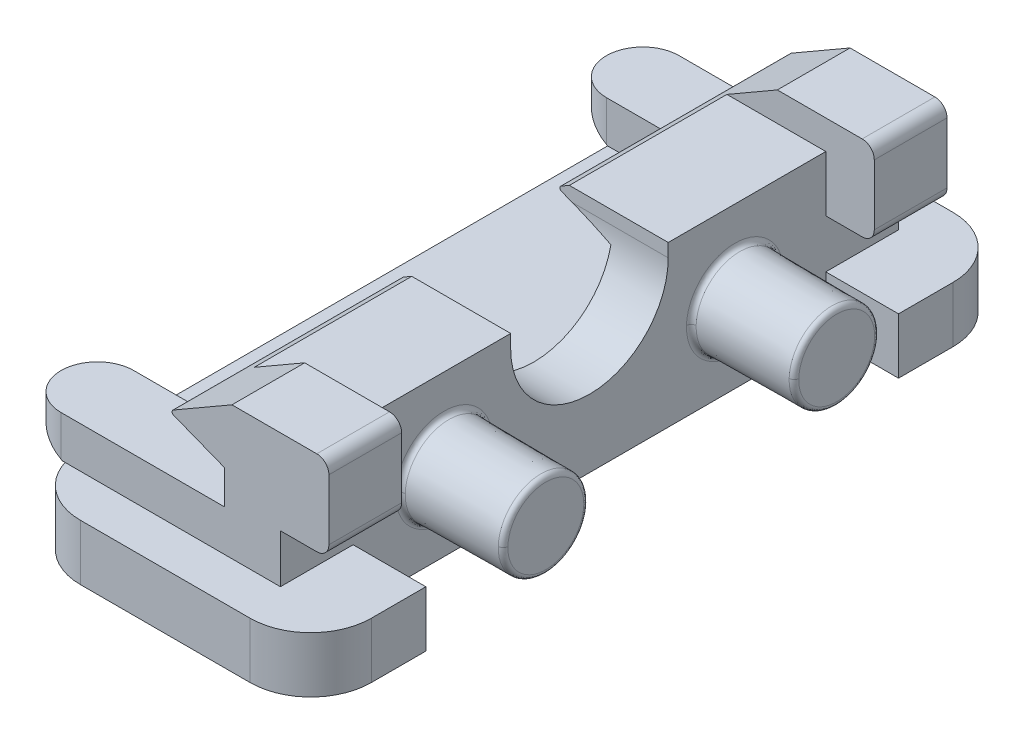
ISO-10303-21;
HEADER;
FILE_DESCRIPTION(('STEP AP214'),'2;1');
FILE_NAME('part.step','',(''),(''),'','','');
FILE_SCHEMA(('AUTOMOTIVE_DESIGN { 1 0 10303 214 1 1 1 1 }'));
ENDSEC;
DATA;
#1=APPLICATION_CONTEXT('core data for automotive mechanical design processes');
#2=APPLICATION_PROTOCOL_DEFINITION('international standard','automotive_design',2000,#1);
#3=PRODUCT_CONTEXT('',#1,'mechanical');
#4=PRODUCT('Part','Part','',(#3));
#5=PRODUCT_RELATED_PRODUCT_CATEGORY('part','',(#4));
#6=PRODUCT_DEFINITION_FORMATION('','',#4);
#7=PRODUCT_DEFINITION_CONTEXT('part definition',#1,'design');
#8=PRODUCT_DEFINITION('design','',#6,#7);
#9=PRODUCT_DEFINITION_SHAPE('','',#8);
#10=(LENGTH_UNIT() NAMED_UNIT(*) SI_UNIT(.MILLI.,.METRE.));
#11=(NAMED_UNIT(*) PLANE_ANGLE_UNIT() SI_UNIT($,.RADIAN.));
#12=(NAMED_UNIT(*) SI_UNIT($,.STERADIAN.) SOLID_ANGLE_UNIT());
#13=UNCERTAINTY_MEASURE_WITH_UNIT(LENGTH_MEASURE(1.E-05),#10,'distance_accuracy_value','');
#14=(GEOMETRIC_REPRESENTATION_CONTEXT(3) GLOBAL_UNCERTAINTY_ASSIGNED_CONTEXT((#13)) GLOBAL_UNIT_ASSIGNED_CONTEXT((#10,
#11,#12)) REPRESENTATION_CONTEXT('',''));
#15=CARTESIAN_POINT('',(0.,0.,0.));
#16=DIRECTION('',(0.,0.,1.));
#17=DIRECTION('',(1.,0.,0.));
#18=AXIS2_PLACEMENT_3D('',#15,#16,#17);
#19=CARTESIAN_POINT('',(20.95,1.815160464,-4.416134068));
#20=DIRECTION('',(1.,0.,0.));
#21=DIRECTION('',(0.,0.,-1.));
#22=AXIS2_PLACEMENT_3D('',#19,#20,#21);
#23=PLANE('',#22);
#24=DIRECTION('',(0.,0.999895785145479,-0.0144367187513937));
#25=VECTOR('',#24,1.);
#26=CARTESIAN_POINT('',(20.95,3.35481532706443,-7.56443252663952));
#27=LINE('',#26,#25);
#28=CARTESIAN_POINT('',(20.950000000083,3.35481532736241,-7.56443252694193));
#29=VERTEX_POINT('',#28);
#30=CARTESIAN_POINT('',(20.9500000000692,3.40000000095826,-7.56508491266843));
#31=VERTEX_POINT('',#30);
#32=EDGE_CURVE('E358',#29,#31,#27,.T.);
#33=ORIENTED_EDGE('',*,*,#32,.T.);
#34=CARTESIAN_POINT('',(20.9500000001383,3.44518467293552,-4.43556747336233));
#35=CARTESIAN_POINT('',(20.9500000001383,6.57404972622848,-4.52593682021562));
#36=CARTESIAN_POINT('',(20.9500000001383,6.4836803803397,-7.65480187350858));
#37=CARTESIAN_POINT('',(20.9500000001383,3.35481532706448,-7.56443252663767));
#38=(BOUNDED_CURVE() B_SPLINE_CURVE(3,(#34,#35,#36,#37),.UNSPECIFIED.,.F.,
.F.) B_SPLINE_CURVE_WITH_KNOTS((4,4),(0.,1.),
.UNSPECIFIED.) CURVE() GEOMETRIC_REPRESENTATION_ITEM() RATIONAL_B_SPLINE_CURVE((0.99570072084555,
0.331900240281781,0.331900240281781,0.99570072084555)) REPRESENTATION_ITEM(''));
#39=CARTESIAN_POINT('',(20.950000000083,3.44518467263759,-4.43556747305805));
#40=VERTEX_POINT('',#39);
#41=EDGE_CURVE('E361',#31,#40,#38,.F.);
#42=ORIENTED_EDGE('',*,*,#41,.T.);
#43=DIRECTION('',(0.,-0.999895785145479,0.0144367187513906));
#44=VECTOR('',#43,1.);
#45=CARTESIAN_POINT('',(20.95,3.44518467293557,-4.43556747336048));
#46=LINE('',#45,#44);
#47=CARTESIAN_POINT('',(20.9500000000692,3.39999999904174,-4.43491508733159));
#48=VERTEX_POINT('',#47);
#49=EDGE_CURVE('E365',#40,#48,#46,.T.);
#50=ORIENTED_EDGE('',*,*,#49,.T.);
#51=CARTESIAN_POINT('',(20.9500000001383,3.35481532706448,-7.56443252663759));
#52=CARTESIAN_POINT('',(20.9500000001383,0.225950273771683,-7.47406317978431));
#53=CARTESIAN_POINT('',(20.9500000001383,0.316319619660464,-4.34519812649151));
#54=CARTESIAN_POINT('',(20.9500000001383,3.44518467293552,-4.43556747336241));
#55=(BOUNDED_CURVE() B_SPLINE_CURVE(3,(#51,#52,#53,#54),.UNSPECIFIED.,.F.,
.F.) B_SPLINE_CURVE_WITH_KNOTS((4,4),(0.,1.),
.UNSPECIFIED.) CURVE() GEOMETRIC_REPRESENTATION_ITEM() RATIONAL_B_SPLINE_CURVE((0.995700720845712,
0.331900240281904,0.331900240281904,0.995700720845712)) REPRESENTATION_ITEM(''));
#56=EDGE_CURVE('E368',#48,#29,#55,.F.);
#57=ORIENTED_EDGE('',*,*,#56,.T.);
#58=EDGE_LOOP('',(#33,#42,#50,#57));
#59=FACE_BOUND('',#58,.T.);
#60=ADVANCED_FACE('F17',(#59),#23,.T.);
#61=CARTESIAN_POINT('',(7.7,4.2,11.25));
#62=DIRECTION('',(0.,-1.,0.));
#63=DIRECTION('',(0.,0.,-1.));
#64=AXIS2_PLACEMENT_3D('',#61,#62,#63);
#65=CYLINDRICAL_SURFACE('',#64,1.5);
#66=DIRECTION('',(0.,1.,0.));
#67=VECTOR('',#66,1.);
#68=CARTESIAN_POINT('',(7.70000000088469,3.3586919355,12.75));
#69=LINE('',#68,#67);
#70=CARTESIAN_POINT('',(7.70000000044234,4.19999999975,12.75));
#71=VERTEX_POINT('',#70);
#72=CARTESIAN_POINT('',(7.70000000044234,2.52741935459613,12.75));
#73=VERTEX_POINT('',#72);
#74=EDGE_CURVE('E1102',#71,#73,#69,.F.);
#75=ORIENTED_EDGE('',*,*,#74,.F.);
#76=CARTESIAN_POINT('',(7.7,4.2,11.25));
#77=DIRECTION('',(0.,-1.,0.));
#78=DIRECTION('',(0.,0.,-1.));
#79=AXIS2_PLACEMENT_3D('',#76,#77,#78);
#80=CIRCLE('',#79,1.5);
#81=CARTESIAN_POINT('',(7.7,4.2,9.75));
#82=VERTEX_POINT('',#81);
#83=EDGE_CURVE('E339',#82,#71,#80,.F.);
#84=ORIENTED_EDGE('',*,*,#83,.F.);
#85=DIRECTION('',(0.,-1.,0.));
#86=VECTOR('',#85,1.);
#87=CARTESIAN_POINT('',(7.7,3.35,9.75));
#88=LINE('',#87,#86);
#89=CARTESIAN_POINT('',(7.7,2.52741935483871,9.75));
#90=VERTEX_POINT('',#89);
#91=EDGE_CURVE('E280',#82,#90,#88,.T.);
#92=ORIENTED_EDGE('',*,*,#91,.T.);
#93=CARTESIAN_POINT('',(7.7,2.52741935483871,11.25));
#94=DIRECTION('',(-0.480832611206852,-0.876812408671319,0.));
#95=DIRECTION('',(0.876812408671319,-0.480832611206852,0.));
#96=AXIS2_PLACEMENT_3D('',#93,#94,#95);
#97=ELLIPSE('',#96,1.7107422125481,1.5);
#98=EDGE_CURVE('E386',#73,#90,#97,.T.);
#99=ORIENTED_EDGE('',*,*,#98,.F.);
#100=EDGE_LOOP('',(#75,#84,#92,#99));
#101=FACE_BOUND('',#100,.T.);
#102=ADVANCED_FACE('F867',(#101),#65,.T.);
#103=CARTESIAN_POINT('',(7.7,2.5,9.75));
#104=DIRECTION('',(0.,0.,1.));
#105=DIRECTION('',(1.,0.,0.));
#106=AXIS2_PLACEMENT_3D('',#103,#104,#105);
#107=PLANE('',#106);
#108=DIRECTION('',(0.,1.,0.));
#109=VECTOR('',#108,1.);
#110=CARTESIAN_POINT('',(14.45,4.05,9.7499999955));
#111=LINE('',#110,#109);
#112=CARTESIAN_POINT('',(14.45,2.5,9.749999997));
#113=VERTEX_POINT('',#112);
#114=CARTESIAN_POINT('',(14.45,4.20000000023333,9.7499999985));
#115=VERTEX_POINT('',#114);
#116=EDGE_CURVE('E348',#113,#115,#111,.T.);
#117=ORIENTED_EDGE('',*,*,#116,.F.);
#118=DIRECTION('',(-1.,0.,0.));
#119=VECTOR('',#118,1.);
#120=CARTESIAN_POINT('',(11.1,2.5,9.75));
#121=LINE('',#120,#119);
#122=CARTESIAN_POINT('',(7.75,2.5,9.75));
#123=VERTEX_POINT('',#122);
#124=EDGE_CURVE('E1055',#113,#123,#121,.T.);
#125=ORIENTED_EDGE('',*,*,#124,.T.);
#126=DIRECTION('',(0.876812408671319,-0.480832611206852,0.));
#127=VECTOR('',#126,1.);
#128=CARTESIAN_POINT('',(6.97035,2.92755,9.75));
#129=LINE('',#128,#127);
#130=EDGE_CURVE('E389',#90,#123,#129,.T.);
#131=ORIENTED_EDGE('',*,*,#130,.F.);
#132=ORIENTED_EDGE('',*,*,#91,.F.);
#133=DIRECTION('',(-1.,0.,0.));
#134=VECTOR('',#133,1.);
#135=CARTESIAN_POINT('',(10.30025,4.2,9.75));
#136=LINE('',#135,#134);
#137=EDGE_CURVE('E1333',#115,#82,#136,.T.);
#138=ORIENTED_EDGE('',*,*,#137,.F.);
#139=EDGE_LOOP('',(#117,#125,#131,#132,#138));
#140=FACE_BOUND('',#139,.T.);
#141=ADVANCED_FACE('F870',(#140),#107,.F.);
#142=CARTESIAN_POINT('',(12.380144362,6.517326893,12.75));
#143=DIRECTION('',(0.,0.,-1.));
#144=DIRECTION('',(-1.,0.,0.));
#145=AXIS2_PLACEMENT_3D('',#142,#143,#144);
#146=CYLINDRICAL_SURFACE('',#145,0.100000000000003);
#147=CARTESIAN_POINT('',(12.380144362,6.517326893,12.75));
#148=DIRECTION('',(0.,0.,-1.));
#149=DIRECTION('',(-1.,0.,0.));
#150=AXIS2_PLACEMENT_3D('',#147,#148,#149);
#151=CIRCLE('',#150,0.100000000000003);
#152=CARTESIAN_POINT('',(12.330172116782,6.60394545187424,12.75));
#153=VERTEX_POINT('',#152);
#154=CARTESIAN_POINT('',(12.3437044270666,6.42420261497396,12.75));
#155=VERTEX_POINT('',#154);
#156=EDGE_CURVE('E22',#153,#155,#151,.F.);
#157=ORIENTED_EDGE('',*,*,#156,.F.);
#158=DIRECTION('',(0.,0.,1.));
#159=VECTOR('',#158,1.);
#160=CARTESIAN_POINT('',(12.330172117,6.603945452,8.));
#161=LINE('',#160,#159);
#162=CARTESIAN_POINT('',(12.330172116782,6.60394545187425,3.25));
#163=VERTEX_POINT('',#162);
#164=EDGE_CURVE('E407',#163,#153,#161,.T.);
#165=ORIENTED_EDGE('',*,*,#164,.F.);
#166=CARTESIAN_POINT('',(12.380144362,6.517326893,3.25));
#167=DIRECTION('',(0.,0.,-1.));
#168=DIRECTION('',(-1.,0.,0.));
#169=AXIS2_PLACEMENT_3D('',#166,#167,#168);
#170=CIRCLE('',#169,0.100000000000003);
#171=CARTESIAN_POINT('',(12.3437044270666,6.42420261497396,3.25000000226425));
#172=VERTEX_POINT('',#171);
#173=EDGE_CURVE('E284',#163,#172,#170,.F.);
#174=ORIENTED_EDGE('',*,*,#173,.T.);
#175=DIRECTION('',(0.,0.,-1.));
#176=VECTOR('',#175,1.);
#177=CARTESIAN_POINT('',(12.343704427,6.424202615,7.938471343));
#178=LINE('',#177,#176);
#179=EDGE_CURVE('E282',#155,#172,#178,.T.);
#180=ORIENTED_EDGE('',*,*,#179,.F.);
#181=EDGE_LOOP('',(#157,#165,#174,#180));
#182=FACE_BOUND('',#181,.T.);
#183=ADVANCED_FACE('F283',(#182),#146,.T.);
#184=CARTESIAN_POINT('',(18.25,7.5,12.75));
#185=DIRECTION('',(0.,0.,-1.));
#186=DIRECTION('',(-1.,0.,0.));
#187=AXIS2_PLACEMENT_3D('',#184,#185,#186);
#188=CYLINDRICAL_SURFACE('',#187,0.499999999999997);
#189=CARTESIAN_POINT('',(18.25,7.5,9.75));
#190=DIRECTION('',(0.,0.,-1.));
#191=DIRECTION('',(-1.,0.,0.));
#192=AXIS2_PLACEMENT_3D('',#189,#190,#191);
#193=CIRCLE('',#192,0.499999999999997);
#194=CARTESIAN_POINT('',(18.2499999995,8.,9.75));
#195=VERTEX_POINT('',#194);
#196=CARTESIAN_POINT('',(18.75,7.4999999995,9.75));
#197=VERTEX_POINT('',#196);
#198=EDGE_CURVE('E391',#195,#197,#193,.T.);
#199=ORIENTED_EDGE('',*,*,#198,.F.);
#200=DIRECTION('',(0.,0.,-1.));
#201=VECTOR('',#200,1.);
#202=CARTESIAN_POINT('',(18.249999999,8.,11.25));
#203=LINE('',#202,#201);
#204=CARTESIAN_POINT('',(18.2499999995,8.,12.75));
#205=VERTEX_POINT('',#204);
#206=EDGE_CURVE('E401',#205,#195,#203,.T.);
#207=ORIENTED_EDGE('',*,*,#206,.F.);
#208=CARTESIAN_POINT('',(18.25,7.5,12.75));
#209=DIRECTION('',(0.,0.,-1.));
#210=DIRECTION('',(-1.,0.,0.));
#211=AXIS2_PLACEMENT_3D('',#208,#209,#210);
#212=CIRCLE('',#211,0.499999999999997);
#213=CARTESIAN_POINT('',(18.75,7.4999999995,12.75));
#214=VERTEX_POINT('',#213);
#215=EDGE_CURVE('E279',#214,#205,#212,.F.);
#216=ORIENTED_EDGE('',*,*,#215,.F.);
#217=DIRECTION('',(0.,0.,1.));
#218=VECTOR('',#217,1.);
#219=CARTESIAN_POINT('',(18.75,7.499999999,11.25));
#220=LINE('',#219,#218);
#221=EDGE_CURVE('E1325',#197,#214,#220,.T.);
#222=ORIENTED_EDGE('',*,*,#221,.F.);
#223=EDGE_LOOP('',(#199,#207,#216,#222));
#224=FACE_BOUND('',#223,.T.);
#225=ADVANCED_FACE('F402',(#224),#188,.T.);
#226=CARTESIAN_POINT('',(6.1907,3.3551,9.75));
#227=DIRECTION('',(-0.480832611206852,-0.876812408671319,0.));
#228=DIRECTION('',(0.876812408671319,-0.480832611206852,0.));
#229=AXIS2_PLACEMENT_3D('',#226,#227,#228);
#230=PLANE('',#229);
#231=ORIENTED_EDGE('',*,*,#130,.T.);
#232=DIRECTION('',(0.,0.,-1.));
#233=VECTOR('',#232,1.);
#234=CARTESIAN_POINT('',(7.75,2.5,0.));
#235=LINE('',#234,#233);
#236=CARTESIAN_POINT('',(7.75,2.5,12.0000000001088));
#237=VERTEX_POINT('',#236);
#238=EDGE_CURVE('E1069',#237,#123,#235,.T.);
#239=ORIENTED_EDGE('',*,*,#238,.F.);
#240=DIRECTION('',(0.,0.,-1.));
#241=VECTOR('',#240,1.);
#242=CARTESIAN_POINT('',(7.75,2.5,12.37275));
#243=LINE('',#242,#241);
#244=CARTESIAN_POINT('',(7.74999999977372,2.5,12.75));
#245=VERTEX_POINT('',#244);
#246=EDGE_CURVE('E343',#245,#237,#243,.T.);
#247=ORIENTED_EDGE('',*,*,#246,.F.);
#248=DIRECTION('',(-0.876812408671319,0.480832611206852,0.));
#249=VECTOR('',#248,1.);
#250=CARTESIAN_POINT('',(6.97035,2.92755,12.75));
#251=LINE('',#250,#249);
#252=EDGE_CURVE('E390',#245,#73,#251,.T.);
#253=ORIENTED_EDGE('',*,*,#252,.T.);
#254=ORIENTED_EDGE('',*,*,#98,.T.);
#255=EDGE_LOOP('',(#231,#239,#247,#253,#254));
#256=FACE_BOUND('',#255,.T.);
#257=ADVANCED_FACE('F930',(#256),#230,.T.);
#258=CARTESIAN_POINT('',(7.75,2.5,-9.75));
#259=DIRECTION('',(0.,-1.,0.));
#260=DIRECTION('',(1.,0.,0.));
#261=AXIS2_PLACEMENT_3D('',#258,#259,#260);
#262=PLANE('',#261);
#263=DIRECTION('',(1.,0.,0.));
#264=VECTOR('',#263,1.);
#265=CARTESIAN_POINT('',(11.075,2.5,-9.75));
#266=LINE('',#265,#264);
#267=CARTESIAN_POINT('',(7.749999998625,2.5,-9.75));
#268=VERTEX_POINT('',#267);
#269=CARTESIAN_POINT('',(14.45,2.5,-9.749999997));
#270=VERTEX_POINT('',#269);
#271=EDGE_CURVE('E369',#268,#270,#266,.T.);
#272=ORIENTED_EDGE('',*,*,#271,.F.);
#273=DIRECTION('',(0.,0.,-1.));
#274=VECTOR('',#273,1.);
#275=CARTESIAN_POINT('',(7.75,2.5,0.));
#276=LINE('',#275,#274);
#277=EDGE_CURVE('E1075',#123,#268,#276,.T.);
#278=ORIENTED_EDGE('',*,*,#277,.F.);
#279=ORIENTED_EDGE('',*,*,#124,.F.);
#280=DIRECTION('',(0.,0.,1.));
#281=VECTOR('',#280,1.);
#282=CARTESIAN_POINT('',(14.45,2.5,0.));
#283=LINE('',#282,#281);
#284=EDGE_CURVE('E1104',#270,#113,#283,.T.);
#285=ORIENTED_EDGE('',*,*,#284,.F.);
#286=EDGE_LOOP('',(#272,#278,#279,#285));
#287=FACE_BOUND('',#286,.T.);
#288=ADVANCED_FACE('F1076',(#287),#262,.F.);
#289=CARTESIAN_POINT('',(6.1907,3.3551,-12.75));
#290=DIRECTION('',(-0.480832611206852,-0.876812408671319,0.));
#291=DIRECTION('',(0.876812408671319,-0.480832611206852,0.));
#292=AXIS2_PLACEMENT_3D('',#289,#290,#291);
#293=PLANE('',#292);
#294=DIRECTION('',(0.876812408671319,-0.480832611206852,0.));
#295=VECTOR('',#294,1.);
#296=CARTESIAN_POINT('',(6.97035,2.92755,-12.75));
#297=LINE('',#296,#295);
#298=CARTESIAN_POINT('',(7.70000000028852,2.52741935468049,-12.75));
#299=VERTEX_POINT('',#298);
#300=CARTESIAN_POINT('',(7.74999999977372,2.5,-12.75));
#301=VERTEX_POINT('',#300);
#302=EDGE_CURVE('E1063',#299,#301,#297,.T.);
#303=ORIENTED_EDGE('',*,*,#302,.T.);
#304=DIRECTION('',(0.,0.,1.));
#305=VECTOR('',#304,1.);
#306=CARTESIAN_POINT('',(7.75,2.5,-11.25));
#307=LINE('',#306,#305);
#308=CARTESIAN_POINT('',(7.75,2.5,-11.9999999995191));
#309=VERTEX_POINT('',#308);
#310=EDGE_CURVE('E385',#301,#309,#307,.T.);
#311=ORIENTED_EDGE('',*,*,#310,.T.);
#312=DIRECTION('',(0.,0.,-1.));
#313=VECTOR('',#312,1.);
#314=CARTESIAN_POINT('',(7.75,2.5,0.));
#315=LINE('',#314,#313);
#316=EDGE_CURVE('E1080',#268,#309,#315,.T.);
#317=ORIENTED_EDGE('',*,*,#316,.F.);
#318=DIRECTION('',(0.876812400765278,-0.48083262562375,0.));
#319=VECTOR('',#318,1.);
#320=CARTESIAN_POINT('',(7.7,2.5274193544,-9.75));
#321=LINE('',#320,#319);
#322=CARTESIAN_POINT('',(7.7,2.52741935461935,-9.75));
#323=VERTEX_POINT('',#322);
#324=EDGE_CURVE('E372',#323,#268,#321,.T.);
#325=ORIENTED_EDGE('',*,*,#324,.F.);
#326=CARTESIAN_POINT('',(7.7,2.52741935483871,-11.25));
#327=DIRECTION('',(-0.480832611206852,-0.876812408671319,0.));
#328=DIRECTION('',(-0.876812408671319,0.480832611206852,0.));
#329=AXIS2_PLACEMENT_3D('',#326,#327,#328);
#330=ELLIPSE('',#329,1.7107422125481,1.5);
#331=EDGE_CURVE('E376',#323,#299,#330,.T.);
#332=ORIENTED_EDGE('',*,*,#331,.T.);
#333=EDGE_LOOP('',(#303,#311,#317,#325,#332));
#334=FACE_BOUND('',#333,.T.);
#335=ADVANCED_FACE('F927',(#334),#293,.T.);
#336=CARTESIAN_POINT('',(18.25,7.5,-9.75));
#337=DIRECTION('',(0.,0.,-1.));
#338=DIRECTION('',(-1.,0.,0.));
#339=AXIS2_PLACEMENT_3D('',#336,#337,#338);
#340=CYLINDRICAL_SURFACE('',#339,0.499999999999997);
#341=CARTESIAN_POINT('',(18.25,7.5,-9.75));
#342=DIRECTION('',(0.,0.,-1.));
#343=DIRECTION('',(-1.,0.,0.));
#344=AXIS2_PLACEMENT_3D('',#341,#342,#343);
#345=CIRCLE('',#344,0.499999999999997);
#346=CARTESIAN_POINT('',(18.75,7.5000017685,-9.75));
#347=VERTEX_POINT('',#346);
#348=CARTESIAN_POINT('',(18.2499999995,8.,-9.75));
#349=VERTEX_POINT('',#348);
#350=EDGE_CURVE('E381',#347,#349,#345,.F.);
#351=ORIENTED_EDGE('',*,*,#350,.F.);
#352=DIRECTION('',(0.,0.,1.));
#353=VECTOR('',#352,1.);
#354=CARTESIAN_POINT('',(18.75,7.500003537,-11.25));
#355=LINE('',#354,#353);
#356=CARTESIAN_POINT('',(18.75,7.5000017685,-12.75));
#357=VERTEX_POINT('',#356);
#358=EDGE_CURVE('E1249',#357,#347,#355,.T.);
#359=ORIENTED_EDGE('',*,*,#358,.F.);
#360=CARTESIAN_POINT('',(18.25,7.5,-12.75));
#361=DIRECTION('',(0.,0.,-1.));
#362=DIRECTION('',(-1.,0.,0.));
#363=AXIS2_PLACEMENT_3D('',#360,#361,#362);
#364=CIRCLE('',#363,0.499999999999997);
#365=CARTESIAN_POINT('',(18.2499999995,8.,-12.75));
#366=VERTEX_POINT('',#365);
#367=EDGE_CURVE('E383',#366,#357,#364,.T.);
#368=ORIENTED_EDGE('',*,*,#367,.F.);
#369=DIRECTION('',(0.,0.,-1.));
#370=VECTOR('',#369,1.);
#371=CARTESIAN_POINT('',(18.249999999,8.,-11.25));
#372=LINE('',#371,#370);
#373=EDGE_CURVE('E1246',#349,#366,#372,.T.);
#374=ORIENTED_EDGE('',*,*,#373,.F.);
#375=EDGE_LOOP('',(#351,#359,#368,#374));
#376=FACE_BOUND('',#375,.T.);
#377=ADVANCED_FACE('F923',(#376),#340,.T.);
#378=CARTESIAN_POINT('',(12.380144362,6.517326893,-3.25));
#379=DIRECTION('',(0.,0.,-1.));
#380=DIRECTION('',(0.,1.,0.));
#381=AXIS2_PLACEMENT_3D('',#378,#379,#380);
#382=CYLINDRICAL_SURFACE('',#381,0.100000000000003);
#383=DIRECTION('',(0.,0.,-1.));
#384=VECTOR('',#383,1.);
#385=CARTESIAN_POINT('',(12.343704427,6.424202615,-7.938471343));
#386=LINE('',#385,#384);
#387=CARTESIAN_POINT('',(12.3437044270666,6.42420261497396,-3.25000000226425));
#388=VERTEX_POINT('',#387);
#389=CARTESIAN_POINT('',(12.3437044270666,6.42420261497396,-12.75));
#390=VERTEX_POINT('',#389);
#391=EDGE_CURVE('E1236',#388,#390,#386,.T.);
#392=ORIENTED_EDGE('',*,*,#391,.F.);
#393=CARTESIAN_POINT('',(12.380144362,6.517326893,-3.25));
#394=DIRECTION('',(0.,0.,-1.));
#395=DIRECTION('',(0.,1.,0.));
#396=AXIS2_PLACEMENT_3D('',#393,#394,#395);
#397=CIRCLE('',#396,0.100000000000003);
#398=CARTESIAN_POINT('',(12.330172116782,6.60394545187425,-3.25));
#399=VERTEX_POINT('',#398);
#400=EDGE_CURVE('E349',#388,#399,#397,.T.);
#401=ORIENTED_EDGE('',*,*,#400,.T.);
#402=DIRECTION('',(0.,0.,1.));
#403=VECTOR('',#402,1.);
#404=CARTESIAN_POINT('',(12.330172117,6.603945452,-8.));
#405=LINE('',#404,#403);
#406=CARTESIAN_POINT('',(12.330172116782,6.60394545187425,-12.75));
#407=VERTEX_POINT('',#406);
#408=EDGE_CURVE('E1164',#407,#399,#405,.T.);
#409=ORIENTED_EDGE('',*,*,#408,.F.);
#410=CARTESIAN_POINT('',(12.380144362,6.51732689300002,-12.75));
#411=DIRECTION('',(0.,0.,-1.));
#412=DIRECTION('',(0.,1.,0.));
#413=AXIS2_PLACEMENT_3D('',#410,#411,#412);
#414=CIRCLE('',#413,0.100000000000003);
#415=EDGE_CURVE('E379',#390,#407,#414,.T.);
#416=ORIENTED_EDGE('',*,*,#415,.F.);
#417=EDGE_LOOP('',(#392,#401,#409,#416));
#418=FACE_BOUND('',#417,.T.);
#419=ADVANCED_FACE('F919',(#418),#382,.T.);
#420=CARTESIAN_POINT('',(7.7,2.517383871,-11.25));
#421=DIRECTION('',(0.,1.,0.));
#422=DIRECTION('',(0.,0.,1.));
#423=AXIS2_PLACEMENT_3D('',#420,#421,#422);
#424=CYLINDRICAL_SURFACE('',#423,1.5);
#425=ORIENTED_EDGE('',*,*,#331,.F.);
#426=DIRECTION('',(0.,-1.,0.));
#427=VECTOR('',#426,1.);
#428=CARTESIAN_POINT('',(7.7,3.35,-9.75));
#429=LINE('',#428,#427);
#430=CARTESIAN_POINT('',(7.7,4.2,-9.75));
#431=VERTEX_POINT('',#430);
#432=EDGE_CURVE('E375',#431,#323,#429,.T.);
#433=ORIENTED_EDGE('',*,*,#432,.F.);
#434=CARTESIAN_POINT('',(7.7,4.2,-11.25));
#435=DIRECTION('',(0.,1.,0.));
#436=DIRECTION('',(0.,0.,1.));
#437=AXIS2_PLACEMENT_3D('',#434,#435,#436);
#438=CIRCLE('',#437,1.5);
#439=CARTESIAN_POINT('',(7.70000000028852,4.19999999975,-12.75));
#440=VERTEX_POINT('',#439);
#441=EDGE_CURVE('E331',#440,#431,#438,.T.);
#442=ORIENTED_EDGE('',*,*,#441,.F.);
#443=DIRECTION('',(0.,-1.,0.));
#444=VECTOR('',#443,1.);
#445=CARTESIAN_POINT('',(7.70000000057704,3.3586919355,-12.75));
#446=LINE('',#445,#444);
#447=EDGE_CURVE('E378',#299,#440,#446,.F.);
#448=ORIENTED_EDGE('',*,*,#447,.F.);
#449=EDGE_LOOP('',(#425,#433,#442,#448));
#450=FACE_BOUND('',#449,.T.);
#451=ADVANCED_FACE('F911',(#450),#424,.T.);
#452=CARTESIAN_POINT('',(7.7,2.5,-9.75));
#453=DIRECTION('',(0.,0.,1.));
#454=DIRECTION('',(1.,0.,0.));
#455=AXIS2_PLACEMENT_3D('',#452,#453,#454);
#456=PLANE('',#455);
#457=ORIENTED_EDGE('',*,*,#324,.T.);
#458=ORIENTED_EDGE('',*,*,#271,.T.);
#459=DIRECTION('',(0.,-1.,0.));
#460=VECTOR('',#459,1.);
#461=CARTESIAN_POINT('',(14.45,4.05,-9.7499999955));
#462=LINE('',#461,#460);
#463=CARTESIAN_POINT('',(14.45,4.20000000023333,-9.7499999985));
#464=VERTEX_POINT('',#463);
#465=EDGE_CURVE('E1114',#464,#270,#462,.T.);
#466=ORIENTED_EDGE('',*,*,#465,.F.);
#467=DIRECTION('',(1.,0.,0.));
#468=VECTOR('',#467,1.);
#469=CARTESIAN_POINT('',(10.30025,4.2,-9.75));
#470=LINE('',#469,#468);
#471=EDGE_CURVE('E330',#431,#464,#470,.T.);
#472=ORIENTED_EDGE('',*,*,#471,.F.);
#473=ORIENTED_EDGE('',*,*,#432,.T.);
#474=EDGE_LOOP('',(#457,#458,#466,#472,#473));
#475=FACE_BOUND('',#474,.T.);
#476=ADVANCED_FACE('F905',(#475),#456,.T.);
#477=CARTESIAN_POINT('',(20.751745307,3.450958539,-4.235658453));
#478=CARTESIAN_POINT('',(20.751745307,-0.077724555,-4.133741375));
#479=CARTESIAN_POINT('',(20.751745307,-0.179641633,-7.662424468));
#480=CARTESIAN_POINT('',(20.751745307,3.349041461,-7.764341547));
#481=CARTESIAN_POINT('',(20.869059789,3.450928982,-4.236681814));
#482=CARTESIAN_POINT('',(20.869059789,-0.075707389,-4.13482385));
#483=CARTESIAN_POINT('',(20.869059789,-0.177565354,-7.661460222));
#484=CARTESIAN_POINT('',(20.869059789,3.349071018,-7.763318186));
#485=CARTESIAN_POINT('',(20.951216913,3.448511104,-4.32039619));
#486=CARTESIAN_POINT('',(20.951216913,0.089303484,-4.223373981));
#487=CARTESIAN_POINT('',(20.951216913,-0.007718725,-7.582581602));
#488=CARTESIAN_POINT('',(20.951216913,3.351488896,-7.67960381));
#489=CARTESIAN_POINT('',(20.949989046,3.445124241,-4.437659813));
#490=CARTESIAN_POINT('',(20.949989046,0.320443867,-4.34741133));
#491=CARTESIAN_POINT('',(20.949989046,0.230195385,-7.472091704));
#492=CARTESIAN_POINT('',(20.949989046,3.354875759,-7.562340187));
#493=(BOUNDED_SURFACE() B_SPLINE_SURFACE(3,3,((#477,#478,#479,#480),(#481,#482,#483,#484),(#485,
#486,#487,#488),(#489,#490,#491,#492)),.UNSPECIFIED.,.F.,.F.,
.F.) B_SPLINE_SURFACE_WITH_KNOTS((4,4),(4,4),(0.,1.),(0.,1.),
.UNSPECIFIED.) GEOMETRIC_REPRESENTATION_ITEM() RATIONAL_B_SPLINE_SURFACE(((1.,0.333333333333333,
0.333333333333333,1.),(0.80432764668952,0.268109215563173,0.268109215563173,0.80432764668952),
(0.80432764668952,0.268109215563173,0.268109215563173,0.80432764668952),(1.,0.333333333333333,
0.333333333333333,1.))) REPRESENTATION_ITEM('') SURFACE());
#494=CARTESIAN_POINT('',(20.751745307,3.450958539,-4.235658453));
#495=CARTESIAN_POINT('',(20.869059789,3.450928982,-4.236681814));
#496=CARTESIAN_POINT('',(20.951216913,3.448511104,-4.32039619));
#497=CARTESIAN_POINT('',(20.949989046,3.445124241,-4.437659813));
#498=(BOUNDED_CURVE() B_SPLINE_CURVE(3,(#494,#495,#496,#497),.UNSPECIFIED.,.F.,
.F.) B_SPLINE_CURVE_WITH_KNOTS((4,4),(0.,1.),
.UNSPECIFIED.) CURVE() GEOMETRIC_REPRESENTATION_ITEM() RATIONAL_B_SPLINE_CURVE((1.,
0.804327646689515,0.804327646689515,1.)) REPRESENTATION_ITEM(''));
#499=CARTESIAN_POINT('',(20.7517453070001,3.45095853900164,-4.2356584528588));
#500=VERTEX_POINT('',#499);
#501=EDGE_CURVE('E357',#40,#500,#498,.F.);
#502=CARTESIAN_POINT('',(20.7517453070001,3.4,-6.));
#503=DIRECTION('',(-1.,0.,0.));
#504=DIRECTION('',(0.,-1.,0.));
#505=AXIS2_PLACEMENT_3D('',#502,#503,#504);
#506=CIRCLE('',#505,1.765077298);
#507=CARTESIAN_POINT('',(20.7517453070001,3.34904146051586,-7.76434154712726));
#508=VERTEX_POINT('',#507);
#509=EDGE_CURVE('E329',#500,#508,#506,.F.);
#510=CARTESIAN_POINT('',(20.751745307,3.349041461,-7.764341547));
#511=CARTESIAN_POINT('',(20.869059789,3.349071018,-7.763318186));
#512=CARTESIAN_POINT('',(20.951216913,3.351488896,-7.67960381));
#513=CARTESIAN_POINT('',(20.949989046,3.354875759,-7.562340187));
#514=(BOUNDED_CURVE() B_SPLINE_CURVE(3,(#510,#511,#512,#513),.UNSPECIFIED.,.F.,
.F.) B_SPLINE_CURVE_WITH_KNOTS((4,4),(0.,1.),
.UNSPECIFIED.) CURVE() GEOMETRIC_REPRESENTATION_ITEM() RATIONAL_B_SPLINE_CURVE((1.,
0.804327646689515,0.804327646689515,1.)) REPRESENTATION_ITEM(''));
#515=EDGE_CURVE('E362',#508,#29,#514,.T.);
#516=ORIENTED_EDGE('',*,*,#501,.T.);
#517=ORIENTED_EDGE('',*,*,#509,.T.);
#518=ORIENTED_EDGE('',*,*,#515,.T.);
#519=ORIENTED_EDGE('',*,*,#56,.F.);
#520=ORIENTED_EDGE('',*,*,#49,.F.);
#521=EDGE_LOOP('',(#516,#517,#518,#519,#520));
#522=FACE_BOUND('',#521,.T.);
#523=ADVANCED_FACE('F892',(#522),#493,.F.);
#524=CARTESIAN_POINT('',(20.751745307,3.349041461,-7.764341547));
#525=CARTESIAN_POINT('',(20.751745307,6.877724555,-7.866258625));
#526=CARTESIAN_POINT('',(20.751745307,6.979641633,-4.337575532));
#527=CARTESIAN_POINT('',(20.751745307,3.450958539,-4.235658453));
#528=CARTESIAN_POINT('',(20.869059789,3.349071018,-7.763318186));
#529=CARTESIAN_POINT('',(20.869059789,6.875707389,-7.86517615));
#530=CARTESIAN_POINT('',(20.869059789,6.977565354,-4.338539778));
#531=CARTESIAN_POINT('',(20.869059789,3.450928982,-4.236681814));
#532=CARTESIAN_POINT('',(20.951216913,3.351488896,-7.67960381));
#533=CARTESIAN_POINT('',(20.951216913,6.710696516,-7.776626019));
#534=CARTESIAN_POINT('',(20.951216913,6.807718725,-4.417418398));
#535=CARTESIAN_POINT('',(20.951216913,3.448511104,-4.32039619));
#536=CARTESIAN_POINT('',(20.949989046,3.354875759,-7.562340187));
#537=CARTESIAN_POINT('',(20.949989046,6.479556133,-7.65258867));
#538=CARTESIAN_POINT('',(20.949989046,6.569804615,-4.527908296));
#539=CARTESIAN_POINT('',(20.949989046,3.445124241,-4.437659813));
#540=(BOUNDED_SURFACE() B_SPLINE_SURFACE(3,3,((#524,#525,#526,#527),(#528,#529,#530,#531),(#532,
#533,#534,#535),(#536,#537,#538,#539)),.UNSPECIFIED.,.F.,.F.,
.F.) B_SPLINE_SURFACE_WITH_KNOTS((4,4),(4,4),(0.,1.),(0.,1.),
.UNSPECIFIED.) GEOMETRIC_REPRESENTATION_ITEM() RATIONAL_B_SPLINE_SURFACE(((1.,0.333333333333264,
0.333333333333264,1.),(0.804327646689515,0.268109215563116,0.268109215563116,0.804327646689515),
(0.804327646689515,0.268109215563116,0.268109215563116,0.804327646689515),(1.,0.333333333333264,
0.333333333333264,1.))) REPRESENTATION_ITEM('') SURFACE());
#541=CARTESIAN_POINT('',(20.7517453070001,3.4,-6.));
#542=DIRECTION('',(-1.,0.,0.));
#543=DIRECTION('',(0.,-1.,0.));
#544=AXIS2_PLACEMENT_3D('',#541,#542,#543);
#545=CIRCLE('',#544,1.765077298);
#546=EDGE_CURVE('E1386',#508,#500,#545,.F.);
#547=ORIENTED_EDGE('',*,*,#501,.F.);
#548=ORIENTED_EDGE('',*,*,#41,.F.);
#549=ORIENTED_EDGE('',*,*,#32,.F.);
#550=ORIENTED_EDGE('',*,*,#515,.F.);
#551=ORIENTED_EDGE('',*,*,#546,.T.);
#552=EDGE_LOOP('',(#547,#548,#549,#550,#551));
#553=FACE_BOUND('',#552,.T.);
#554=ADVANCED_FACE('F904',(#553),#540,.F.);
#555=CARTESIAN_POINT('',(18.25,5.,-9.75));
#556=DIRECTION('',(0.,0.,-1.));
#557=DIRECTION('',(-1.,0.,0.));
#558=AXIS2_PLACEMENT_3D('',#555,#556,#557);
#559=CYLINDRICAL_SURFACE('',#558,0.499999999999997);
#560=CARTESIAN_POINT('',(18.25,5.,-9.75));
#561=DIRECTION('',(0.,0.,-1.));
#562=DIRECTION('',(-1.,0.,0.));
#563=AXIS2_PLACEMENT_3D('',#560,#561,#562);
#564=CIRCLE('',#563,0.499999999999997);
#565=CARTESIAN_POINT('',(18.2499999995,4.5,-9.75));
#566=VERTEX_POINT('',#565);
#567=CARTESIAN_POINT('',(18.75,4.9999982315,-9.75));
#568=VERTEX_POINT('',#567);
#569=EDGE_CURVE('E353',#566,#568,#564,.F.);
#570=ORIENTED_EDGE('',*,*,#569,.F.);
#571=DIRECTION('',(0.,0.,1.));
#572=VECTOR('',#571,1.);
#573=CARTESIAN_POINT('',(18.249999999,4.5,-11.25));
#574=LINE('',#573,#572);
#575=CARTESIAN_POINT('',(18.2499999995,4.500000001,-12.75));
#576=VERTEX_POINT('',#575);
#577=EDGE_CURVE('E325',#576,#566,#574,.T.);
#578=ORIENTED_EDGE('',*,*,#577,.F.);
#579=CARTESIAN_POINT('',(18.25,5.,-12.75));
#580=DIRECTION('',(0.,0.,-1.));
#581=DIRECTION('',(-1.,0.,0.));
#582=AXIS2_PLACEMENT_3D('',#579,#580,#581);
#583=CIRCLE('',#582,0.499999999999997);
#584=CARTESIAN_POINT('',(18.75,4.9999982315,-12.75));
#585=VERTEX_POINT('',#584);
#586=EDGE_CURVE('E355',#585,#576,#583,.T.);
#587=ORIENTED_EDGE('',*,*,#586,.F.);
#588=DIRECTION('',(0.,0.,-1.));
#589=VECTOR('',#588,1.);
#590=CARTESIAN_POINT('',(18.75,4.999996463,-11.25));
#591=LINE('',#590,#589);
#592=EDGE_CURVE('E1250',#568,#585,#591,.T.);
#593=ORIENTED_EDGE('',*,*,#592,.F.);
#594=EDGE_LOOP('',(#570,#578,#587,#593));
#595=FACE_BOUND('',#594,.T.);
#596=ADVANCED_FACE('F1833',(#595),#559,.T.);
#597=CARTESIAN_POINT('',(12.253325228,6.25,-3.25));
#598=DIRECTION('',(0.,0.,-1.));
#599=DIRECTION('',(0.,1.,0.));
#600=AXIS2_PLACEMENT_3D('',#597,#598,#599);
#601=PLANE('',#600);
#602=ORIENTED_EDGE('',*,*,#400,.F.);
#603=DIRECTION('',(-0.931242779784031,0.36439934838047,0.));
#604=VECTOR('',#603,1.);
#605=CARTESIAN_POINT('',(13.3968522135,6.0121013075,-3.25000000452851));
#606=LINE('',#605,#604);
#607=CARTESIAN_POINT('',(12.7888888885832,6.24999999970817,-3.25000000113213));
#608=VERTEX_POINT('',#607);
#609=EDGE_CURVE('E1163',#608,#388,#606,.T.);
#610=ORIENTED_EDGE('',*,*,#609,.F.);
#611=DIRECTION('',(1.,0.,0.));
#612=VECTOR('',#611,1.);
#613=CARTESIAN_POINT('',(14.757561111,6.24999999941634,-3.25));
#614=LINE('',#613,#612);
#615=CARTESIAN_POINT('',(16.75,6.24999999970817,-3.25));
#616=VERTEX_POINT('',#615);
#617=EDGE_CURVE('E320',#616,#608,#614,.F.);
#618=ORIENTED_EDGE('',*,*,#617,.F.);
#619=DIRECTION('',(0.,-1.,0.));
#620=VECTOR('',#619,1.);
#621=CARTESIAN_POINT('',(16.75,6.525,-3.25));
#622=LINE('',#621,#620);
#623=CARTESIAN_POINT('',(16.75,6.8,-3.25));
#624=VERTEX_POINT('',#623);
#625=EDGE_CURVE('E352',#624,#616,#622,.T.);
#626=ORIENTED_EDGE('',*,*,#625,.F.);
#627=DIRECTION('',(1.,0.,0.));
#628=VECTOR('',#627,1.);
#629=CARTESIAN_POINT('',(14.71,6.8,-3.25));
#630=LINE('',#629,#628);
#631=CARTESIAN_POINT('',(12.6699999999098,6.79999999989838,-3.25));
#632=VERTEX_POINT('',#631);
#633=EDGE_CURVE('E424',#632,#624,#630,.T.);
#634=ORIENTED_EDGE('',*,*,#633,.F.);
#635=DIRECTION('',(0.866185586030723,0.499722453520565,0.));
#636=VECTOR('',#635,1.);
#637=CARTESIAN_POINT('',(13.5400860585,7.301972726,-3.25));
#638=LINE('',#637,#636);
#639=EDGE_CURVE('E1161',#399,#632,#638,.T.);
#640=ORIENTED_EDGE('',*,*,#639,.F.);
#641=EDGE_LOOP('',(#602,#610,#618,#626,#634,#640));
#642=FACE_BOUND('',#641,.T.);
#643=ADVANCED_FACE('F1824',(#642),#601,.F.);
#644=CARTESIAN_POINT('',(14.45,5.6,-12.75));
#645=DIRECTION('',(-1.,0.,0.));
#646=DIRECTION('',(0.,-1.,0.));
#647=AXIS2_PLACEMENT_3D('',#644,#645,#646);
#648=PLANE('',#647);
#649=ORIENTED_EDGE('',*,*,#116,.T.);
#650=DIRECTION('',(0.,0.,-1.));
#651=VECTOR('',#650,1.);
#652=CARTESIAN_POINT('',(14.45,4.2,11.25));
#653=LINE('',#652,#651);
#654=CARTESIAN_POINT('',(14.4500000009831,4.20000000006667,12.75));
#655=VERTEX_POINT('',#654);
#656=EDGE_CURVE('E342',#655,#115,#653,.T.);
#657=ORIENTED_EDGE('',*,*,#656,.F.);
#658=DIRECTION('',(0.,1.,0.));
#659=VECTOR('',#658,1.);
#660=CARTESIAN_POINT('',(14.45,4.05,12.75));
#661=LINE('',#660,#659);
#662=CARTESIAN_POINT('',(14.45,5.6,12.75));
#663=VERTEX_POINT('',#662);
#664=EDGE_CURVE('E351',#655,#663,#661,.T.);
#665=ORIENTED_EDGE('',*,*,#664,.T.);
#666=DIRECTION('',(0.,0.,1.));
#667=VECTOR('',#666,1.);
#668=CARTESIAN_POINT('',(14.45,5.6,7.938471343));
#669=LINE('',#668,#667);
#670=CARTESIAN_POINT('',(14.4499999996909,5.60000000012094,3.18433666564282));
#671=VERTEX_POINT('',#670);
#672=EDGE_CURVE('E289',#671,#663,#669,.T.);
#673=ORIENTED_EDGE('',*,*,#672,.F.);
#674=CARTESIAN_POINT('',(14.4499999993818,6.25,0.));
#675=DIRECTION('',(1.,0.,0.));
#676=DIRECTION('',(0.,0.,-1.));
#677=AXIS2_PLACEMENT_3D('',#674,#675,#676);
#678=CIRCLE('',#677,3.25);
#679=CARTESIAN_POINT('',(14.4499999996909,5.60000000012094,-3.18433666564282));
#680=VERTEX_POINT('',#679);
#681=EDGE_CURVE('E314',#680,#671,#678,.F.);
#682=ORIENTED_EDGE('',*,*,#681,.F.);
#683=DIRECTION('',(0.,0.,1.));
#684=VECTOR('',#683,1.);
#685=CARTESIAN_POINT('',(14.45,5.6,-7.938471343));
#686=LINE('',#685,#684);
#687=CARTESIAN_POINT('',(14.45,5.6,-12.75));
#688=VERTEX_POINT('',#687);
#689=EDGE_CURVE('E1232',#688,#680,#686,.T.);
#690=ORIENTED_EDGE('',*,*,#689,.F.);
#691=DIRECTION('',(0.,-1.,0.));
#692=VECTOR('',#691,1.);
#693=CARTESIAN_POINT('',(14.45,4.05,-12.75));
#694=LINE('',#693,#692);
#695=CARTESIAN_POINT('',(14.4500000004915,4.20000000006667,-12.75));
#696=VERTEX_POINT('',#695);
#697=EDGE_CURVE('E1098',#688,#696,#694,.T.);
#698=ORIENTED_EDGE('',*,*,#697,.T.);
#699=DIRECTION('',(0.,0.,-1.));
#700=VECTOR('',#699,1.);
#701=CARTESIAN_POINT('',(14.45,4.2,-11.25));
#702=LINE('',#701,#700);
#703=EDGE_CURVE('E334',#464,#696,#702,.T.);
#704=ORIENTED_EDGE('',*,*,#703,.F.);
#705=ORIENTED_EDGE('',*,*,#465,.T.);
#706=ORIENTED_EDGE('',*,*,#284,.T.);
#707=EDGE_LOOP('',(#649,#657,#665,#673,#682,#690,#698,#704,#705,#706));
#708=FACE_BOUND('',#707,.T.);
#709=ADVANCED_FACE('F1815',(#708),#648,.T.);
#710=CARTESIAN_POINT('',(12.253325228,6.8,3.25));
#711=DIRECTION('',(0.,0.,1.));
#712=DIRECTION('',(0.,-1.,0.));
#713=AXIS2_PLACEMENT_3D('',#710,#711,#712);
#714=PLANE('',#713);
#715=DIRECTION('',(0.,1.,0.));
#716=VECTOR('',#715,1.);
#717=CARTESIAN_POINT('',(16.75,6.525,3.25));
#718=LINE('',#717,#716);
#719=CARTESIAN_POINT('',(16.75,6.24999999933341,3.25));
#720=VERTEX_POINT('',#719);
#721=CARTESIAN_POINT('',(16.75,6.8,3.25));
#722=VERTEX_POINT('',#721);
#723=EDGE_CURVE('E346',#720,#722,#718,.T.);
#724=ORIENTED_EDGE('',*,*,#723,.F.);
#725=DIRECTION('',(-1.,0.,0.));
#726=VECTOR('',#725,1.);
#727=CARTESIAN_POINT('',(14.757561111,6.24999999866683,3.25));
#728=LINE('',#727,#726);
#729=CARTESIAN_POINT('',(12.7888888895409,6.24999999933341,3.25000000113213));
#730=VERTEX_POINT('',#729);
#731=EDGE_CURVE('E421',#730,#720,#728,.F.);
#732=ORIENTED_EDGE('',*,*,#731,.F.);
#733=DIRECTION('',(0.931242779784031,-0.36439934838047,0.));
#734=VECTOR('',#733,1.);
#735=CARTESIAN_POINT('',(13.3968522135,6.0121013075,3.2500000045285));
#736=LINE('',#735,#734);
#737=EDGE_CURVE('E288',#172,#730,#736,.T.);
#738=ORIENTED_EDGE('',*,*,#737,.F.);
#739=ORIENTED_EDGE('',*,*,#173,.F.);
#740=DIRECTION('',(-0.866185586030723,-0.499722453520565,0.));
#741=VECTOR('',#740,1.);
#742=CARTESIAN_POINT('',(13.5400860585,7.301972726,3.25));
#743=LINE('',#742,#741);
#744=CARTESIAN_POINT('',(12.6699999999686,6.7999999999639,3.25));
#745=VERTEX_POINT('',#744);
#746=EDGE_CURVE('E1331',#745,#163,#743,.T.);
#747=ORIENTED_EDGE('',*,*,#746,.F.);
#748=DIRECTION('',(-1.,0.,0.));
#749=VECTOR('',#748,1.);
#750=CARTESIAN_POINT('',(14.71,6.8,3.25));
#751=LINE('',#750,#749);
#752=EDGE_CURVE('E309',#722,#745,#751,.T.);
#753=ORIENTED_EDGE('',*,*,#752,.F.);
#754=EDGE_LOOP('',(#724,#732,#738,#739,#747,#753));
#755=FACE_BOUND('',#754,.T.);
#756=ADVANCED_FACE('F1806',(#755),#714,.F.);
#757=CARTESIAN_POINT('',(18.25,5.,12.75));
#758=DIRECTION('',(0.,0.,-1.));
#759=DIRECTION('',(-1.,0.,0.));
#760=AXIS2_PLACEMENT_3D('',#757,#758,#759);
#761=CYLINDRICAL_SURFACE('',#760,0.5);
#762=CARTESIAN_POINT('',(18.25,5.,9.75));
#763=DIRECTION('',(0.,0.,-1.));
#764=DIRECTION('',(-1.,0.,0.));
#765=AXIS2_PLACEMENT_3D('',#762,#763,#764);
#766=CIRCLE('',#765,0.5);
#767=CARTESIAN_POINT('',(18.2499999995,4.5,9.75));
#768=VERTEX_POINT('',#767);
#769=CARTESIAN_POINT('',(18.75,5.0000000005,9.75));
#770=VERTEX_POINT('',#769);
#771=EDGE_CURVE('E303',#768,#770,#766,.F.);
#772=ORIENTED_EDGE('',*,*,#771,.T.);
#773=DIRECTION('',(0.,0.,-1.));
#774=VECTOR('',#773,1.);
#775=CARTESIAN_POINT('',(18.75,5.000000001,11.25));
#776=LINE('',#775,#774);
#777=CARTESIAN_POINT('',(18.75,5.0000000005,12.75));
#778=VERTEX_POINT('',#777);
#779=EDGE_CURVE('E1282',#778,#770,#776,.T.);
#780=ORIENTED_EDGE('',*,*,#779,.F.);
#781=CARTESIAN_POINT('',(18.25,5.,12.75));
#782=DIRECTION('',(0.,0.,-1.));
#783=DIRECTION('',(-1.,0.,0.));
#784=AXIS2_PLACEMENT_3D('',#781,#782,#783);
#785=CIRCLE('',#784,0.5);
#786=CARTESIAN_POINT('',(18.2499999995,4.500000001,12.75));
#787=VERTEX_POINT('',#786);
#788=EDGE_CURVE('E344',#787,#778,#785,.F.);
#789=ORIENTED_EDGE('',*,*,#788,.F.);
#790=DIRECTION('',(0.,0.,1.));
#791=VECTOR('',#790,1.);
#792=CARTESIAN_POINT('',(18.249999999,4.5,11.25));
#793=LINE('',#792,#791);
#794=EDGE_CURVE('E1307',#768,#787,#793,.T.);
#795=ORIENTED_EDGE('',*,*,#794,.F.);
#796=EDGE_LOOP('',(#772,#780,#789,#795));
#797=FACE_BOUND('',#796,.T.);
#798=ADVANCED_FACE('F1797',(#797),#761,.T.);
#799=CARTESIAN_POINT('',(7.75,2.5,11.9955));
#800=DIRECTION('',(0.,-1.,0.));
#801=DIRECTION('',(1.,0.,0.));
#802=AXIS2_PLACEMENT_3D('',#799,#800,#801);
#803=PLANE('',#802);
#804=CARTESIAN_POINT('',(10.25,2.5,12.));
#805=DIRECTION('',(0.,-1.,0.));
#806=DIRECTION('',(1.,0.,0.));
#807=AXIS2_PLACEMENT_3D('',#804,#805,#806);
#808=CIRCLE('',#807,2.5);
#809=CARTESIAN_POINT('',(7.86515199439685,2.5,12.7500000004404));
#810=VERTEX_POINT('',#809);
#811=EDGE_CURVE('E335',#237,#810,#808,.F.);
#812=ORIENTED_EDGE('',*,*,#811,.T.);
#813=DIRECTION('',(-1.,0.,0.));
#814=VECTOR('',#813,1.);
#815=CARTESIAN_POINT('',(13.224998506,2.5,12.75));
#816=LINE('',#815,#814);
#817=EDGE_CURVE('E299',#810,#245,#816,.T.);
#818=ORIENTED_EDGE('',*,*,#817,.T.);
#819=ORIENTED_EDGE('',*,*,#246,.T.);
#820=EDGE_LOOP('',(#812,#818,#819));
#821=FACE_BOUND('',#820,.T.);
#822=ADVANCED_FACE('F1788',(#821),#803,.T.);
#823=CARTESIAN_POINT('',(14.45,4.2,9.75));
#824=DIRECTION('',(0.,1.,0.));
#825=DIRECTION('',(-1.,0.,0.));
#826=AXIS2_PLACEMENT_3D('',#823,#824,#825);
#827=PLANE('',#826);
#828=ORIENTED_EDGE('',*,*,#656,.T.);
#829=ORIENTED_EDGE('',*,*,#137,.T.);
#830=ORIENTED_EDGE('',*,*,#83,.T.);
#831=DIRECTION('',(1.,0.,0.));
#832=VECTOR('',#831,1.);
#833=CARTESIAN_POINT('',(13.224998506,4.1999999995,12.75));
#834=LINE('',#833,#832);
#835=EDGE_CURVE('E294',#71,#655,#834,.T.);
#836=ORIENTED_EDGE('',*,*,#835,.T.);
#837=EDGE_LOOP('',(#828,#829,#830,#836));
#838=FACE_BOUND('',#837,.T.);
#839=ADVANCED_FACE('F1780',(#838),#827,.T.);
#840=CARTESIAN_POINT('',(12.343704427,6.424202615,3.126942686));
#841=DIRECTION('',(-0.36439934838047,-0.931242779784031,0.));
#842=DIRECTION('',(0.931242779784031,-0.36439934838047,0.));
#843=AXIS2_PLACEMENT_3D('',#840,#841,#842);
#844=PLANE('',#843);
#845=ORIENTED_EDGE('',*,*,#737,.T.);
#846=CARTESIAN_POINT('',(12.7888888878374,6.25,0.));
#847=DIRECTION('',(-0.36439934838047,-0.931242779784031,0.));
#848=DIRECTION('',(0.931242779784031,-0.36439934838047,0.));
#849=AXIS2_PLACEMENT_3D('',#846,#847,#848);
#850=ELLIPSE('',#849,8.91878653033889,3.25);
#851=EDGE_CURVE('E310',#671,#730,#850,.T.);
#852=ORIENTED_EDGE('',*,*,#851,.F.);
#853=ORIENTED_EDGE('',*,*,#672,.T.);
#854=DIRECTION('',(0.931242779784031,-0.36439934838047,0.));
#855=VECTOR('',#854,1.);
#856=CARTESIAN_POINT('',(12.343704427,6.424202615,12.75));
#857=LINE('',#856,#855);
#858=EDGE_CURVE('E276',#663,#155,#857,.F.);
#859=ORIENTED_EDGE('',*,*,#858,.T.);
#860=ORIENTED_EDGE('',*,*,#179,.T.);
#861=EDGE_LOOP('',(#845,#852,#853,#859,#860));
#862=FACE_BOUND('',#861,.T.);
#863=ADVANCED_FACE('F292',(#862),#844,.T.);
#864=CARTESIAN_POINT('',(14.75,8.,3.25));
#865=DIRECTION('',(-0.499722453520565,0.866185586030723,0.));
#866=DIRECTION('',(-0.866185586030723,-0.499722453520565,0.));
#867=AXIS2_PLACEMENT_3D('',#864,#865,#866);
#868=PLANE('',#867);
#869=DIRECTION('',(-0.866185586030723,-0.499722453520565,0.));
#870=VECTOR('',#869,1.);
#871=CARTESIAN_POINT('',(14.75,8.,12.75));
#872=LINE('',#871,#870);
#873=CARTESIAN_POINT('',(14.75,8.,12.75));
#874=VERTEX_POINT('',#873);
#875=EDGE_CURVE('E278',#153,#874,#872,.F.);
#876=ORIENTED_EDGE('',*,*,#875,.T.);
#877=DIRECTION('',(0.,0.,1.));
#878=VECTOR('',#877,1.);
#879=CARTESIAN_POINT('',(14.75,8.,11.25));
#880=LINE('',#879,#878);
#881=CARTESIAN_POINT('',(14.75,8.,9.75));
#882=VERTEX_POINT('',#881);
#883=EDGE_CURVE('E406',#882,#874,#880,.T.);
#884=ORIENTED_EDGE('',*,*,#883,.F.);
#885=DIRECTION('',(-0.866185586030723,-0.499722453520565,0.));
#886=VECTOR('',#885,1.);
#887=CARTESIAN_POINT('',(14.75,8.,9.75));
#888=LINE('',#887,#886);
#889=CARTESIAN_POINT('',(12.6699999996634,6.7999999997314,9.75));
#890=VERTEX_POINT('',#889);
#891=EDGE_CURVE('E307',#882,#890,#888,.T.);
#892=ORIENTED_EDGE('',*,*,#891,.T.);
#893=DIRECTION('',(0.,0.,1.));
#894=VECTOR('',#893,1.);
#895=CARTESIAN_POINT('',(12.67,6.8,6.5));
#896=LINE('',#895,#894);
#897=EDGE_CURVE('E313',#745,#890,#896,.T.);
#898=ORIENTED_EDGE('',*,*,#897,.F.);
#899=ORIENTED_EDGE('',*,*,#746,.T.);
#900=ORIENTED_EDGE('',*,*,#164,.T.);
#901=EDGE_LOOP('',(#876,#884,#892,#898,#899,#900));
#902=FACE_BOUND('',#901,.T.);
#903=ADVANCED_FACE('F1764',(#902),#868,.T.);
#904=CARTESIAN_POINT('',(18.249999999,8.,9.75));
#905=DIRECTION('',(0.,1.,0.));
#906=DIRECTION('',(-1.,0.,0.));
#907=AXIS2_PLACEMENT_3D('',#904,#905,#906);
#908=PLANE('',#907);
#909=ORIENTED_EDGE('',*,*,#883,.T.);
#910=DIRECTION('',(1.,0.,0.));
#911=VECTOR('',#910,1.);
#912=CARTESIAN_POINT('',(13.224998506,8.,12.75));
#913=LINE('',#912,#911);
#914=EDGE_CURVE('E296',#874,#205,#913,.T.);
#915=ORIENTED_EDGE('',*,*,#914,.T.);
#916=ORIENTED_EDGE('',*,*,#206,.T.);
#917=DIRECTION('',(-1.,0.,0.));
#918=VECTOR('',#917,1.);
#919=CARTESIAN_POINT('',(15.69176,8.,9.75));
#920=LINE('',#919,#918);
#921=EDGE_CURVE('E416',#195,#882,#920,.T.);
#922=ORIENTED_EDGE('',*,*,#921,.T.);
#923=EDGE_LOOP('',(#909,#915,#916,#922));
#924=FACE_BOUND('',#923,.T.);
#925=ADVANCED_FACE('F410',(#924),#908,.T.);
#926=CARTESIAN_POINT('',(18.75,5.000000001,9.75));
#927=DIRECTION('',(1.,0.,0.));
#928=DIRECTION('',(0.,1.,0.));
#929=AXIS2_PLACEMENT_3D('',#926,#927,#928);
#930=PLANE('',#929);
#931=DIRECTION('',(0.,-1.,0.));
#932=VECTOR('',#931,1.);
#933=CARTESIAN_POINT('',(18.75,5.25,12.75));
#934=LINE('',#933,#932);
#935=EDGE_CURVE('E396',#214,#778,#934,.T.);
#936=ORIENTED_EDGE('',*,*,#935,.T.);
#937=ORIENTED_EDGE('',*,*,#779,.T.);
#938=DIRECTION('',(0.,1.,0.));
#939=VECTOR('',#938,1.);
#940=CARTESIAN_POINT('',(18.75,6.25,9.75));
#941=LINE('',#940,#939);
#942=EDGE_CURVE('E305',#770,#197,#941,.T.);
#943=ORIENTED_EDGE('',*,*,#942,.T.);
#944=ORIENTED_EDGE('',*,*,#221,.T.);
#945=EDGE_LOOP('',(#936,#937,#943,#944));
#946=FACE_BOUND('',#945,.T.);
#947=ADVANCED_FACE('F1747',(#946),#930,.T.);
#948=CARTESIAN_POINT('',(19.75,2.5,9.75));
#949=DIRECTION('',(1.,0.,0.));
#950=DIRECTION('',(0.,0.,1.));
#951=AXIS2_PLACEMENT_3D('',#948,#949,#950);
#952=PLANE('',#951);
#953=DIRECTION('',(0.,1.,0.));
#954=VECTOR('',#953,1.);
#955=CARTESIAN_POINT('',(19.75,1.35,9.75));
#956=LINE('',#955,#954);
#957=CARTESIAN_POINT('',(19.75,0.2,9.75000000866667));
#958=VERTEX_POINT('',#957);
#959=CARTESIAN_POINT('',(19.75,2.5,9.75));
#960=VERTEX_POINT('',#959);
#961=EDGE_CURVE('E672',#958,#960,#956,.T.);
#962=ORIENTED_EDGE('',*,*,#961,.T.);
#963=DIRECTION('',(0.,0.,1.));
#964=VECTOR('',#963,1.);
#965=CARTESIAN_POINT('',(19.75,2.5,12.125));
#966=LINE('',#965,#964);
#967=CARTESIAN_POINT('',(19.75,2.5,12.0000000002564));
#968=VERTEX_POINT('',#967);
#969=EDGE_CURVE('E674',#960,#968,#966,.T.);
#970=ORIENTED_EDGE('',*,*,#969,.T.);
#971=DIRECTION('',(0.,1.,0.));
#972=VECTOR('',#971,1.);
#973=CARTESIAN_POINT('',(19.75,1.35,12.0000000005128));
#974=LINE('',#973,#972);
#975=CARTESIAN_POINT('',(19.75,0.2,12.0000000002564));
#976=VERTEX_POINT('',#975);
#977=EDGE_CURVE('E1280',#968,#976,#974,.F.);
#978=ORIENTED_EDGE('',*,*,#977,.T.);
#979=DIRECTION('',(0.,0.,1.));
#980=VECTOR('',#979,1.);
#981=CARTESIAN_POINT('',(19.75,0.2,0.));
#982=LINE('',#981,#980);
#983=EDGE_CURVE('E663',#958,#976,#982,.T.);
#984=ORIENTED_EDGE('',*,*,#983,.F.);
#985=EDGE_LOOP('',(#962,#970,#978,#984));
#986=FACE_BOUND('',#985,.T.);
#987=ADVANCED_FACE('F1738',(#986),#952,.T.);
#988=CARTESIAN_POINT('',(17.25,2.5,12.));
#989=DIRECTION('',(0.,-1.,0.));
#990=DIRECTION('',(1.,0.,0.));
#991=AXIS2_PLACEMENT_3D('',#988,#989,#990);
#992=CYLINDRICAL_SURFACE('',#991,2.5);
#993=ORIENTED_EDGE('',*,*,#977,.F.);
#994=CARTESIAN_POINT('',(17.25,2.5,12.));
#995=DIRECTION('',(0.,-1.,0.));
#996=DIRECTION('',(1.,0.,0.));
#997=AXIS2_PLACEMENT_3D('',#994,#995,#996);
#998=CIRCLE('',#997,2.5);
#999=CARTESIAN_POINT('',(17.25,2.5,14.5));
#1000=VERTEX_POINT('',#999);
#1001=EDGE_CURVE('E673',#968,#1000,#998,.T.);
#1002=ORIENTED_EDGE('',*,*,#1001,.T.);
#1003=DIRECTION('',(0.,1.,0.));
#1004=VECTOR('',#1003,1.);
#1005=CARTESIAN_POINT('',(17.25,1.35,14.5));
#1006=LINE('',#1005,#1004);
#1007=CARTESIAN_POINT('',(17.25,0.2,14.5));
#1008=VERTEX_POINT('',#1007);
#1009=EDGE_CURVE('E338',#1008,#1000,#1006,.T.);
#1010=ORIENTED_EDGE('',*,*,#1009,.F.);
#1011=CARTESIAN_POINT('',(17.25,0.200000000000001,12.));
#1012=DIRECTION('',(0.,-1.,0.));
#1013=DIRECTION('',(1.,0.,0.));
#1014=AXIS2_PLACEMENT_3D('',#1011,#1012,#1013);
#1015=CIRCLE('',#1014,2.5);
#1016=EDGE_CURVE('E662',#976,#1008,#1015,.T.);
#1017=ORIENTED_EDGE('',*,*,#1016,.F.);
#1018=EDGE_LOOP('',(#993,#1002,#1010,#1017));
#1019=FACE_BOUND('',#1018,.T.);
#1020=ADVANCED_FACE('F1729',(#1019),#992,.T.);
#1021=CARTESIAN_POINT('',(17.25,2.5,14.5));
#1022=DIRECTION('',(0.,0.,1.));
#1023=DIRECTION('',(-1.,0.,0.));
#1024=AXIS2_PLACEMENT_3D('',#1021,#1022,#1023);
#1025=PLANE('',#1024);
#1026=DIRECTION('',(-1.,0.,0.));
#1027=VECTOR('',#1026,1.);
#1028=CARTESIAN_POINT('',(13.771921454,2.5,14.5));
#1029=LINE('',#1028,#1027);
#1030=CARTESIAN_POINT('',(10.2499999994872,2.5,14.5));
#1031=VERTEX_POINT('',#1030);
#1032=EDGE_CURVE('E669',#1000,#1031,#1029,.T.);
#1033=ORIENTED_EDGE('',*,*,#1032,.T.);
#1034=DIRECTION('',(0.,1.,0.));
#1035=VECTOR('',#1034,1.);
#1036=CARTESIAN_POINT('',(10.2499999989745,1.35,14.5));
#1037=LINE('',#1036,#1035);
#1038=CARTESIAN_POINT('',(10.2499999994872,0.2,14.5));
#1039=VERTEX_POINT('',#1038);
#1040=EDGE_CURVE('E337',#1031,#1039,#1037,.F.);
#1041=ORIENTED_EDGE('',*,*,#1040,.T.);
#1042=DIRECTION('',(-1.,0.,0.));
#1043=VECTOR('',#1042,1.);
#1044=CARTESIAN_POINT('',(13.75,0.2,14.5));
#1045=LINE('',#1044,#1043);
#1046=EDGE_CURVE('E659',#1008,#1039,#1045,.T.);
#1047=ORIENTED_EDGE('',*,*,#1046,.F.);
#1048=ORIENTED_EDGE('',*,*,#1009,.T.);
#1049=EDGE_LOOP('',(#1033,#1041,#1047,#1048));
#1050=FACE_BOUND('',#1049,.T.);
#1051=ADVANCED_FACE('F1721',(#1050),#1025,.T.);
#1052=CARTESIAN_POINT('',(10.25,2.5,12.));
#1053=DIRECTION('',(0.,-1.,0.));
#1054=DIRECTION('',(1.,0.,0.));
#1055=AXIS2_PLACEMENT_3D('',#1052,#1053,#1054);
#1056=CYLINDRICAL_SURFACE('',#1055,2.5);
#1057=CARTESIAN_POINT('',(10.25,0.2,12.));
#1058=DIRECTION('',(0.,-1.,0.));
#1059=DIRECTION('',(1.,0.,0.));
#1060=AXIS2_PLACEMENT_3D('',#1057,#1058,#1059);
#1061=CIRCLE('',#1060,2.5);
#1062=CARTESIAN_POINT('',(7.75,0.2,12.));
#1063=VERTEX_POINT('',#1062);
#1064=EDGE_CURVE('E658',#1039,#1063,#1061,.T.);
#1065=ORIENTED_EDGE('',*,*,#1064,.F.);
#1066=ORIENTED_EDGE('',*,*,#1040,.F.);
#1067=CARTESIAN_POINT('',(10.25,2.5,12.));
#1068=DIRECTION('',(0.,-1.,0.));
#1069=DIRECTION('',(1.,0.,0.));
#1070=AXIS2_PLACEMENT_3D('',#1067,#1068,#1069);
#1071=CIRCLE('',#1070,2.5);
#1072=EDGE_CURVE('E681',#1031,#810,#1071,.T.);
#1073=ORIENTED_EDGE('',*,*,#1072,.T.);
#1074=ORIENTED_EDGE('',*,*,#811,.F.);
#1075=DIRECTION('',(0.,1.,0.));
#1076=VECTOR('',#1075,1.);
#1077=CARTESIAN_POINT('',(7.75,1.35,12.));
#1078=LINE('',#1077,#1076);
#1079=EDGE_CURVE('E1084',#1063,#237,#1078,.T.);
#1080=ORIENTED_EDGE('',*,*,#1079,.F.);
#1081=EDGE_LOOP('',(#1065,#1066,#1073,#1074,#1080));
#1082=FACE_BOUND('',#1081,.T.);
#1083=ADVANCED_FACE('F1713',(#1082),#1056,.T.);
#1084=CARTESIAN_POINT('',(7.75,2.5,12.));
#1085=DIRECTION('',(-1.,0.,0.));
#1086=DIRECTION('',(0.,0.,-1.));
#1087=AXIS2_PLACEMENT_3D('',#1084,#1085,#1086);
#1088=PLANE('',#1087);
#1089=DIRECTION('',(0.,1.,0.));
#1090=VECTOR('',#1089,1.);
#1091=CARTESIAN_POINT('',(7.75,1.35,-11.9999999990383));
#1092=LINE('',#1091,#1090);
#1093=CARTESIAN_POINT('',(7.75,0.2,-11.9999999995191));
#1094=VERTEX_POINT('',#1093);
#1095=EDGE_CURVE('E1173',#309,#1094,#1092,.F.);
#1096=ORIENTED_EDGE('',*,*,#1095,.T.);
#1097=DIRECTION('',(0.,0.,-1.));
#1098=VECTOR('',#1097,1.);
#1099=CARTESIAN_POINT('',(7.75,0.2,0.));
#1100=LINE('',#1099,#1098);
#1101=EDGE_CURVE('E655',#1063,#1094,#1100,.T.);
#1102=ORIENTED_EDGE('',*,*,#1101,.F.);
#1103=ORIENTED_EDGE('',*,*,#1079,.T.);
#1104=ORIENTED_EDGE('',*,*,#238,.T.);
#1105=ORIENTED_EDGE('',*,*,#277,.T.);
#1106=ORIENTED_EDGE('',*,*,#316,.T.);
#1107=EDGE_LOOP('',(#1096,#1102,#1103,#1104,#1105,#1106));
#1108=FACE_BOUND('',#1107,.T.);
#1109=ADVANCED_FACE('F1082',(#1108),#1088,.T.);
#1110=CARTESIAN_POINT('',(10.25,2.5,-12.));
#1111=DIRECTION('',(0.,-1.,0.));
#1112=DIRECTION('',(1.,0.,0.));
#1113=AXIS2_PLACEMENT_3D('',#1110,#1111,#1112);
#1114=CYLINDRICAL_SURFACE('',#1113,2.5);
#1115=ORIENTED_EDGE('',*,*,#1095,.F.);
#1116=CARTESIAN_POINT('',(10.25,2.5,-12.));
#1117=DIRECTION('',(0.,-1.,0.));
#1118=DIRECTION('',(1.,0.,0.));
#1119=AXIS2_PLACEMENT_3D('',#1116,#1117,#1118);
#1120=CIRCLE('',#1119,2.5);
#1121=CARTESIAN_POINT('',(7.86515199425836,2.5,-12.75));
#1122=VERTEX_POINT('',#1121);
#1123=EDGE_CURVE('E326',#1122,#309,#1120,.F.);
#1124=ORIENTED_EDGE('',*,*,#1123,.F.);
#1125=CARTESIAN_POINT('',(10.25,2.5,-12.));
#1126=DIRECTION('',(0.,-1.,0.));
#1127=DIRECTION('',(1.,0.,0.));
#1128=AXIS2_PLACEMENT_3D('',#1125,#1126,#1127);
#1129=CIRCLE('',#1128,2.5);
#1130=CARTESIAN_POINT('',(10.25,2.5,-14.5));
#1131=VERTEX_POINT('',#1130);
#1132=EDGE_CURVE('E643',#1122,#1131,#1129,.T.);
#1133=ORIENTED_EDGE('',*,*,#1132,.T.);
#1134=DIRECTION('',(0.,1.,0.));
#1135=VECTOR('',#1134,1.);
#1136=CARTESIAN_POINT('',(10.25,1.35,-14.5));
#1137=LINE('',#1136,#1135);
#1138=CARTESIAN_POINT('',(10.25,0.2,-14.5));
#1139=VERTEX_POINT('',#1138);
#1140=EDGE_CURVE('E1192',#1139,#1131,#1137,.T.);
#1141=ORIENTED_EDGE('',*,*,#1140,.F.);
#1142=CARTESIAN_POINT('',(10.25,0.2,-12.));
#1143=DIRECTION('',(0.,-1.,0.));
#1144=DIRECTION('',(1.,0.,0.));
#1145=AXIS2_PLACEMENT_3D('',#1142,#1143,#1144);
#1146=CIRCLE('',#1145,2.5);
#1147=EDGE_CURVE('E654',#1094,#1139,#1146,.T.);
#1148=ORIENTED_EDGE('',*,*,#1147,.F.);
#1149=EDGE_LOOP('',(#1115,#1124,#1133,#1141,#1148));
#1150=FACE_BOUND('',#1149,.T.);
#1151=ADVANCED_FACE('F1191',(#1150),#1114,.T.);
#1152=CARTESIAN_POINT('',(10.25,2.5,-14.5));
#1153=DIRECTION('',(0.,0.,-1.));
#1154=DIRECTION('',(1.,0.,0.));
#1155=AXIS2_PLACEMENT_3D('',#1152,#1153,#1154);
#1156=PLANE('',#1155);
#1157=DIRECTION('',(1.,0.,0.));
#1158=VECTOR('',#1157,1.);
#1159=CARTESIAN_POINT('',(13.771921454,2.5,-14.5));
#1160=LINE('',#1159,#1158);
#1161=CARTESIAN_POINT('',(17.25,2.5,-14.5));
#1162=VERTEX_POINT('',#1161);
#1163=EDGE_CURVE('E641',#1131,#1162,#1160,.T.);
#1164=ORIENTED_EDGE('',*,*,#1163,.T.);
#1165=DIRECTION('',(0.,1.,0.));
#1166=VECTOR('',#1165,1.);
#1167=CARTESIAN_POINT('',(17.25,1.35,-14.5));
#1168=LINE('',#1167,#1166);
#1169=CARTESIAN_POINT('',(17.25,0.2,-14.5));
#1170=VERTEX_POINT('',#1169);
#1171=EDGE_CURVE('E1258',#1162,#1170,#1168,.F.);
#1172=ORIENTED_EDGE('',*,*,#1171,.T.);
#1173=DIRECTION('',(1.,0.,0.));
#1174=VECTOR('',#1173,1.);
#1175=CARTESIAN_POINT('',(13.75,0.2,-14.5));
#1176=LINE('',#1175,#1174);
#1177=EDGE_CURVE('E651',#1139,#1170,#1176,.T.);
#1178=ORIENTED_EDGE('',*,*,#1177,.F.);
#1179=ORIENTED_EDGE('',*,*,#1140,.T.);
#1180=EDGE_LOOP('',(#1164,#1172,#1178,#1179));
#1181=FACE_BOUND('',#1180,.T.);
#1182=ADVANCED_FACE('F1689',(#1181),#1156,.T.);
#1183=CARTESIAN_POINT('',(17.25,2.5,-12.));
#1184=DIRECTION('',(0.,-1.,0.));
#1185=DIRECTION('',(1.,0.,0.));
#1186=AXIS2_PLACEMENT_3D('',#1183,#1184,#1185);
#1187=CYLINDRICAL_SURFACE('',#1186,2.5);
#1188=ORIENTED_EDGE('',*,*,#1171,.F.);
#1189=CARTESIAN_POINT('',(17.25,2.5,-12.));
#1190=DIRECTION('',(0.,-1.,0.));
#1191=DIRECTION('',(1.,0.,0.));
#1192=AXIS2_PLACEMENT_3D('',#1189,#1190,#1191);
#1193=CIRCLE('',#1192,2.5);
#1194=CARTESIAN_POINT('',(19.75,2.5,-12.));
#1195=VERTEX_POINT('',#1194);
#1196=EDGE_CURVE('E638',#1162,#1195,#1193,.T.);
#1197=ORIENTED_EDGE('',*,*,#1196,.T.);
#1198=DIRECTION('',(0.,1.,0.));
#1199=VECTOR('',#1198,1.);
#1200=CARTESIAN_POINT('',(19.75,1.35,-12.));
#1201=LINE('',#1200,#1199);
#1202=CARTESIAN_POINT('',(19.75,0.2,-12.));
#1203=VERTEX_POINT('',#1202);
#1204=EDGE_CURVE('E1253',#1203,#1195,#1201,.T.);
#1205=ORIENTED_EDGE('',*,*,#1204,.F.);
#1206=CARTESIAN_POINT('',(17.25,0.2,-12.));
#1207=DIRECTION('',(0.,-1.,0.));
#1208=DIRECTION('',(1.,0.,0.));
#1209=AXIS2_PLACEMENT_3D('',#1206,#1207,#1208);
#1210=CIRCLE('',#1209,2.5);
#1211=EDGE_CURVE('E648',#1170,#1203,#1210,.T.);
#1212=ORIENTED_EDGE('',*,*,#1211,.F.);
#1213=EDGE_LOOP('',(#1188,#1197,#1205,#1212));
#1214=FACE_BOUND('',#1213,.T.);
#1215=ADVANCED_FACE('F1680',(#1214),#1187,.T.);
#1216=CARTESIAN_POINT('',(19.75,2.5,-12.));
#1217=DIRECTION('',(1.,0.,0.));
#1218=DIRECTION('',(0.,0.,1.));
#1219=AXIS2_PLACEMENT_3D('',#1216,#1217,#1218);
#1220=PLANE('',#1219);
#1221=DIRECTION('',(0.,-1.,0.));
#1222=VECTOR('',#1221,1.);
#1223=CARTESIAN_POINT('',(19.75,1.35,-9.75));
#1224=LINE('',#1223,#1222);
#1225=CARTESIAN_POINT('',(19.75,2.5,-9.75));
#1226=VERTEX_POINT('',#1225);
#1227=CARTESIAN_POINT('',(19.75,0.2,-9.75000000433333));
#1228=VERTEX_POINT('',#1227);
#1229=EDGE_CURVE('E647',#1226,#1228,#1224,.T.);
#1230=ORIENTED_EDGE('',*,*,#1229,.T.);
#1231=DIRECTION('',(0.,0.,1.));
#1232=VECTOR('',#1231,1.);
#1233=CARTESIAN_POINT('',(19.75,0.2,0.));
#1234=LINE('',#1233,#1232);
#1235=EDGE_CURVE('E644',#1203,#1228,#1234,.T.);
#1236=ORIENTED_EDGE('',*,*,#1235,.F.);
#1237=ORIENTED_EDGE('',*,*,#1204,.T.);
#1238=DIRECTION('',(0.,0.,1.));
#1239=VECTOR('',#1238,1.);
#1240=CARTESIAN_POINT('',(19.75,2.5,-12.125));
#1241=LINE('',#1240,#1239);
#1242=EDGE_CURVE('E635',#1195,#1226,#1241,.T.);
#1243=ORIENTED_EDGE('',*,*,#1242,.T.);
#1244=EDGE_LOOP('',(#1230,#1236,#1237,#1243));
#1245=FACE_BOUND('',#1244,.T.);
#1246=ADVANCED_FACE('F1671',(#1245),#1220,.T.);
#1247=CARTESIAN_POINT('',(18.75,4.999996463,-12.75));
#1248=DIRECTION('',(1.,0.,0.));
#1249=DIRECTION('',(0.,1.,0.));
#1250=AXIS2_PLACEMENT_3D('',#1247,#1248,#1249);
#1251=PLANE('',#1250);
#1252=DIRECTION('',(0.,1.,0.));
#1253=VECTOR('',#1252,1.);
#1254=CARTESIAN_POINT('',(18.75,5.25,-12.75));
#1255=LINE('',#1254,#1253);
#1256=EDGE_CURVE('E632',#585,#357,#1255,.T.);
#1257=ORIENTED_EDGE('',*,*,#1256,.T.);
#1258=ORIENTED_EDGE('',*,*,#358,.T.);
#1259=DIRECTION('',(0.,-1.,0.));
#1260=VECTOR('',#1259,1.);
#1261=CARTESIAN_POINT('',(18.75,6.25,-9.75));
#1262=LINE('',#1261,#1260);
#1263=EDGE_CURVE('E431',#347,#568,#1262,.T.);
#1264=ORIENTED_EDGE('',*,*,#1263,.T.);
#1265=ORIENTED_EDGE('',*,*,#592,.T.);
#1266=EDGE_LOOP('',(#1257,#1258,#1264,#1265));
#1267=FACE_BOUND('',#1266,.T.);
#1268=ADVANCED_FACE('F1662',(#1267),#1251,.T.);
#1269=CARTESIAN_POINT('',(18.249999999,8.,-12.75));
#1270=DIRECTION('',(0.,1.,0.));
#1271=DIRECTION('',(-1.,0.,0.));
#1272=AXIS2_PLACEMENT_3D('',#1269,#1270,#1271);
#1273=PLANE('',#1272);
#1274=ORIENTED_EDGE('',*,*,#373,.T.);
#1275=DIRECTION('',(-1.,0.,0.));
#1276=VECTOR('',#1275,1.);
#1277=CARTESIAN_POINT('',(13.224998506,8.,-12.75));
#1278=LINE('',#1277,#1276);
#1279=CARTESIAN_POINT('',(14.75,8.,-12.75));
#1280=VERTEX_POINT('',#1279);
#1281=EDGE_CURVE('E629',#366,#1280,#1278,.T.);
#1282=ORIENTED_EDGE('',*,*,#1281,.T.);
#1283=DIRECTION('',(0.,0.,-1.));
#1284=VECTOR('',#1283,1.);
#1285=CARTESIAN_POINT('',(14.75,8.,-8.));
#1286=LINE('',#1285,#1284);
#1287=CARTESIAN_POINT('',(14.75,8.,-9.75));
#1288=VERTEX_POINT('',#1287);
#1289=EDGE_CURVE('E1243',#1288,#1280,#1286,.T.);
#1290=ORIENTED_EDGE('',*,*,#1289,.F.);
#1291=DIRECTION('',(1.,0.,0.));
#1292=VECTOR('',#1291,1.);
#1293=CARTESIAN_POINT('',(15.69176,8.,-9.75));
#1294=LINE('',#1293,#1292);
#1295=EDGE_CURVE('E324',#1288,#349,#1294,.T.);
#1296=ORIENTED_EDGE('',*,*,#1295,.T.);
#1297=EDGE_LOOP('',(#1274,#1282,#1290,#1296));
#1298=FACE_BOUND('',#1297,.T.);
#1299=ADVANCED_FACE('F1653',(#1298),#1273,.T.);
#1300=CARTESIAN_POINT('',(14.75,8.,-12.75));
#1301=DIRECTION('',(-0.499722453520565,0.866185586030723,0.));
#1302=DIRECTION('',(-0.866185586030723,-0.499722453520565,0.));
#1303=AXIS2_PLACEMENT_3D('',#1300,#1301,#1302);
#1304=PLANE('',#1303);
#1305=ORIENTED_EDGE('',*,*,#408,.T.);
#1306=ORIENTED_EDGE('',*,*,#639,.T.);
#1307=DIRECTION('',(0.,0.,1.));
#1308=VECTOR('',#1307,1.);
#1309=CARTESIAN_POINT('',(12.67,6.8,-6.5));
#1310=LINE('',#1309,#1308);
#1311=CARTESIAN_POINT('',(12.670000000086,6.8,-9.75));
#1312=VERTEX_POINT('',#1311);
#1313=EDGE_CURVE('E1169',#1312,#632,#1310,.T.);
#1314=ORIENTED_EDGE('',*,*,#1313,.F.);
#1315=DIRECTION('',(-0.866185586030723,-0.499722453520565,0.));
#1316=VECTOR('',#1315,1.);
#1317=CARTESIAN_POINT('',(14.75,8.,-9.75));
#1318=LINE('',#1317,#1316);
#1319=EDGE_CURVE('E321',#1312,#1288,#1318,.F.);
#1320=ORIENTED_EDGE('',*,*,#1319,.T.);
#1321=ORIENTED_EDGE('',*,*,#1289,.T.);
#1322=DIRECTION('',(-0.866185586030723,-0.499722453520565,0.));
#1323=VECTOR('',#1322,1.);
#1324=CARTESIAN_POINT('',(14.75,8.,-12.75));
#1325=LINE('',#1324,#1323);
#1326=EDGE_CURVE('E631',#1280,#407,#1325,.T.);
#1327=ORIENTED_EDGE('',*,*,#1326,.T.);
#1328=EDGE_LOOP('',(#1305,#1306,#1314,#1320,#1321,#1327));
#1329=FACE_BOUND('',#1328,.T.);
#1330=ADVANCED_FACE('F1644',(#1329),#1304,.T.);
#1331=CARTESIAN_POINT('',(12.343704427,6.424202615,-12.75));
#1332=DIRECTION('',(-0.36439934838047,-0.931242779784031,0.));
#1333=DIRECTION('',(0.931242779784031,-0.36439934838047,0.));
#1334=AXIS2_PLACEMENT_3D('',#1331,#1332,#1333);
#1335=PLANE('',#1334);
#1336=ORIENTED_EDGE('',*,*,#689,.T.);
#1337=CARTESIAN_POINT('',(12.7888888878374,6.25,0.));
#1338=DIRECTION('',(-0.36439934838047,-0.931242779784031,0.));
#1339=DIRECTION('',(0.931242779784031,-0.36439934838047,0.));
#1340=AXIS2_PLACEMENT_3D('',#1337,#1338,#1339);
#1341=ELLIPSE('',#1340,8.91878653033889,3.25);
#1342=EDGE_CURVE('E317',#608,#680,#1341,.T.);
#1343=ORIENTED_EDGE('',*,*,#1342,.F.);
#1344=ORIENTED_EDGE('',*,*,#609,.T.);
#1345=ORIENTED_EDGE('',*,*,#391,.T.);
#1346=DIRECTION('',(0.931242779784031,-0.36439934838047,0.));
#1347=VECTOR('',#1346,1.);
#1348=CARTESIAN_POINT('',(12.343704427,6.424202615,-12.75));
#1349=LINE('',#1348,#1347);
#1350=EDGE_CURVE('E711',#390,#688,#1349,.T.);
#1351=ORIENTED_EDGE('',*,*,#1350,.T.);
#1352=EDGE_LOOP('',(#1336,#1343,#1344,#1345,#1351));
#1353=FACE_BOUND('',#1352,.T.);
#1354=ADVANCED_FACE('F1636',(#1353),#1335,.T.);
#1355=CARTESIAN_POINT('',(14.45,4.2,-12.75));
#1356=DIRECTION('',(0.,1.,0.));
#1357=DIRECTION('',(-1.,0.,0.));
#1358=AXIS2_PLACEMENT_3D('',#1355,#1356,#1357);
#1359=PLANE('',#1358);
#1360=ORIENTED_EDGE('',*,*,#441,.T.);
#1361=ORIENTED_EDGE('',*,*,#471,.T.);
#1362=ORIENTED_EDGE('',*,*,#703,.T.);
#1363=DIRECTION('',(-1.,0.,0.));
#1364=VECTOR('',#1363,1.);
#1365=CARTESIAN_POINT('',(13.224998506,4.1999999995,-12.75));
#1366=LINE('',#1365,#1364);
#1367=EDGE_CURVE('E714',#696,#440,#1366,.T.);
#1368=ORIENTED_EDGE('',*,*,#1367,.T.);
#1369=EDGE_LOOP('',(#1360,#1361,#1362,#1368));
#1370=FACE_BOUND('',#1369,.T.);
#1371=ADVANCED_FACE('F1629',(#1370),#1359,.T.);
#1372=CARTESIAN_POINT('',(7.75,2.5,-12.75));
#1373=DIRECTION('',(0.,-1.,0.));
#1374=DIRECTION('',(1.,0.,0.));
#1375=AXIS2_PLACEMENT_3D('',#1372,#1373,#1374);
#1376=PLANE('',#1375);
#1377=ORIENTED_EDGE('',*,*,#310,.F.);
#1378=DIRECTION('',(1.,0.,0.));
#1379=VECTOR('',#1378,1.);
#1380=CARTESIAN_POINT('',(13.224998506,2.5,-12.75));
#1381=LINE('',#1380,#1379);
#1382=EDGE_CURVE('E1194',#301,#1122,#1381,.T.);
#1383=ORIENTED_EDGE('',*,*,#1382,.T.);
#1384=ORIENTED_EDGE('',*,*,#1123,.T.);
#1385=EDGE_LOOP('',(#1377,#1383,#1384));
#1386=FACE_BOUND('',#1385,.T.);
#1387=ADVANCED_FACE('F837',(#1386),#1376,.T.);
#1388=CARTESIAN_POINT('',(20.751745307,3.4,-6.));
#1389=DIRECTION('',(-1.,0.,0.));
#1390=DIRECTION('',(0.,0.,1.));
#1391=AXIS2_PLACEMENT_3D('',#1388,#1389,#1390);
#1392=CONICAL_SURFACE('',#1391,1.765077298,0.00872664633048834);
#1393=ORIENTED_EDGE('',*,*,#509,.F.);
#1394=ORIENTED_EDGE('',*,*,#546,.F.);
#1395=EDGE_LOOP('',(#1393,#1394));
#1396=FACE_BOUND('',#1395,.T.);
#1397=CARTESIAN_POINT('',(16.948254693,3.4,-6.));
#1398=DIRECTION('',(-1.,0.,0.));
#1399=DIRECTION('',(0.,0.,1.));
#1400=AXIS2_PLACEMENT_3D('',#1397,#1398,#1399);
#1401=CIRCLE('',#1400,1.798269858);
#1402=CARTESIAN_POINT('',(16.948254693,3.45191682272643,-4.20247972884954));
#1403=VERTEX_POINT('',#1402);
#1404=CARTESIAN_POINT('',(16.948254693,3.34808317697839,-7.7975202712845));
#1405=VERTEX_POINT('',#1404);
#1406=EDGE_CURVE('E625',#1403,#1405,#1401,.T.);
#1407=ORIENTED_EDGE('',*,*,#1406,.F.);
#1408=CARTESIAN_POINT('',(16.948254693,3.4,-6.));
#1409=DIRECTION('',(-1.,0.,0.));
#1410=DIRECTION('',(0.,0.,1.));
#1411=AXIS2_PLACEMENT_3D('',#1408,#1409,#1410);
#1412=CIRCLE('',#1411,1.798269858);
#1413=EDGE_CURVE('E561',#1405,#1403,#1412,.T.);
#1414=ORIENTED_EDGE('',*,*,#1413,.F.);
#1415=EDGE_LOOP('',(#1407,#1414));
#1416=FACE_BOUND('',#1415,.T.);
#1417=ADVANCED_FACE('F835',(#1396,#1416),#1392,.T.);
#1418=CARTESIAN_POINT('',(20.95,1.815160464,7.583865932));
#1419=DIRECTION('',(1.,0.,0.));
#1420=DIRECTION('',(0.,0.,-1.));
#1421=AXIS2_PLACEMENT_3D('',#1418,#1419,#1420);
#1422=PLANE('',#1421);
#1423=DIRECTION('',(0.,0.999895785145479,-0.0144367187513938));
#1424=VECTOR('',#1423,1.);
#1425=CARTESIAN_POINT('',(20.95,3.35481532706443,4.43556747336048));
#1426=LINE('',#1425,#1424);
#1427=CARTESIAN_POINT('',(20.950000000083,3.35481532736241,4.43556747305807));
#1428=VERTEX_POINT('',#1427);
#1429=CARTESIAN_POINT('',(20.9500000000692,3.40000000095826,4.43491508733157));
#1430=VERTEX_POINT('',#1429);
#1431=EDGE_CURVE('E727',#1428,#1430,#1426,.T.);
#1432=ORIENTED_EDGE('',*,*,#1431,.T.);
#1433=CARTESIAN_POINT('',(20.9500000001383,3.44518467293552,7.56443252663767));
#1434=CARTESIAN_POINT('',(20.9500000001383,6.57404972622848,7.47406317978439));
#1435=CARTESIAN_POINT('',(20.9500000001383,6.4836803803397,4.34519812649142));
#1436=CARTESIAN_POINT('',(20.9500000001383,3.35481532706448,4.43556747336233));
#1437=(BOUNDED_CURVE() B_SPLINE_CURVE(3,(#1433,#1434,#1435,#1436),.UNSPECIFIED.,.F.,
.F.) B_SPLINE_CURVE_WITH_KNOTS((4,4),(0.,1.),
.UNSPECIFIED.) CURVE() GEOMETRIC_REPRESENTATION_ITEM() RATIONAL_B_SPLINE_CURVE((0.99570072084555,
0.331900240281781,0.331900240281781,0.99570072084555)) REPRESENTATION_ITEM(''));
#1438=CARTESIAN_POINT('',(20.950000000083,3.44518467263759,7.56443252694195));
#1439=VERTEX_POINT('',#1438);
#1440=EDGE_CURVE('E442',#1430,#1439,#1437,.F.);
#1441=ORIENTED_EDGE('',*,*,#1440,.T.);
#1442=DIRECTION('',(0.,-0.999895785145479,0.0144367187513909));
#1443=VECTOR('',#1442,1.);
#1444=CARTESIAN_POINT('',(20.95,3.44518467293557,7.56443252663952));
#1445=LINE('',#1444,#1443);
#1446=CARTESIAN_POINT('',(20.9500000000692,3.39999999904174,7.56508491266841));
#1447=VERTEX_POINT('',#1446);
#1448=EDGE_CURVE('E721',#1439,#1447,#1445,.T.);
#1449=ORIENTED_EDGE('',*,*,#1448,.T.);
#1450=CARTESIAN_POINT('',(20.9500000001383,3.35481532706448,4.43556747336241));
#1451=CARTESIAN_POINT('',(20.9500000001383,0.225950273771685,4.52593682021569));
#1452=CARTESIAN_POINT('',(20.9500000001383,0.316319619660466,7.65480187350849));
#1453=CARTESIAN_POINT('',(20.9500000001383,3.44518467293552,7.56443252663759));
#1454=(BOUNDED_CURVE() B_SPLINE_CURVE(3,(#1450,#1451,#1452,#1453),.UNSPECIFIED.,.F.,
.F.) B_SPLINE_CURVE_WITH_KNOTS((4,4),(0.,1.),
.UNSPECIFIED.) CURVE() GEOMETRIC_REPRESENTATION_ITEM() RATIONAL_B_SPLINE_CURVE((0.995700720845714,
0.331900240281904,0.331900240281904,0.995700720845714)) REPRESENTATION_ITEM(''));
#1455=EDGE_CURVE('E724',#1447,#1428,#1454,.F.);
#1456=ORIENTED_EDGE('',*,*,#1455,.T.);
#1457=EDGE_LOOP('',(#1432,#1441,#1449,#1456));
#1458=FACE_BOUND('',#1457,.T.);
#1459=ADVANCED_FACE('F824',(#1458),#1422,.T.);
#1460=CARTESIAN_POINT('',(16.75,4.5,-12.75));
#1461=DIRECTION('',(0.,-1.,0.));
#1462=DIRECTION('',(1.,0.,0.));
#1463=AXIS2_PLACEMENT_3D('',#1460,#1461,#1462);
#1464=PLANE('',#1463);
#1465=DIRECTION('',(1.,0.,0.));
#1466=VECTOR('',#1465,1.);
#1467=CARTESIAN_POINT('',(13.224998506,4.500000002,-12.75));
#1468=LINE('',#1467,#1466);
#1469=CARTESIAN_POINT('',(16.7500000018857,4.500000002,-12.75));
#1470=VERTEX_POINT('',#1469);
#1471=EDGE_CURVE('E619',#1470,#576,#1468,.T.);
#1472=ORIENTED_EDGE('',*,*,#1471,.T.);
#1473=ORIENTED_EDGE('',*,*,#577,.T.);
#1474=DIRECTION('',(-1.,0.,0.));
#1475=VECTOR('',#1474,1.);
#1476=CARTESIAN_POINT('',(15.69176,4.5,-9.75));
#1477=LINE('',#1476,#1475);
#1478=CARTESIAN_POINT('',(16.7499999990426,4.5000000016,-9.7499999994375));
#1479=VERTEX_POINT('',#1478);
#1480=EDGE_CURVE('E427',#566,#1479,#1477,.T.);
#1481=ORIENTED_EDGE('',*,*,#1480,.T.);
#1482=DIRECTION('',(0.,0.,1.));
#1483=VECTOR('',#1482,1.);
#1484=CARTESIAN_POINT('',(16.75,4.5000000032,0.));
#1485=LINE('',#1484,#1483);
#1486=EDGE_CURVE('E441',#1470,#1479,#1485,.T.);
#1487=ORIENTED_EDGE('',*,*,#1486,.F.);
#1488=EDGE_LOOP('',(#1472,#1473,#1481,#1487));
#1489=FACE_BOUND('',#1488,.T.);
#1490=ADVANCED_FACE('F834',(#1489),#1464,.T.);
#1491=CARTESIAN_POINT('',(18.75,4.5,-9.75));
#1492=DIRECTION('',(0.,0.,-1.));
#1493=DIRECTION('',(-1.,0.,0.));
#1494=AXIS2_PLACEMENT_3D('',#1491,#1492,#1493);
#1495=PLANE('',#1494);
#1496=ORIENTED_EDGE('',*,*,#1480,.F.);
#1497=ORIENTED_EDGE('',*,*,#569,.T.);
#1498=ORIENTED_EDGE('',*,*,#1263,.F.);
#1499=ORIENTED_EDGE('',*,*,#350,.T.);
#1500=ORIENTED_EDGE('',*,*,#1295,.F.);
#1501=ORIENTED_EDGE('',*,*,#1319,.F.);
#1502=DIRECTION('',(-1.,0.,0.));
#1503=VECTOR('',#1502,1.);
#1504=CARTESIAN_POINT('',(14.71,6.8,-9.75));
#1505=LINE('',#1504,#1503);
#1506=CARTESIAN_POINT('',(16.7499999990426,6.79999999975,-9.749999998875));
#1507=VERTEX_POINT('',#1506);
#1508=EDGE_CURVE('E430',#1507,#1312,#1505,.T.);
#1509=ORIENTED_EDGE('',*,*,#1508,.F.);
#1510=DIRECTION('',(0.,1.,0.));
#1511=VECTOR('',#1510,1.);
#1512=CARTESIAN_POINT('',(16.75,3.5,-9.7499999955));
#1513=LINE('',#1512,#1511);
#1514=EDGE_CURVE('E1122',#1479,#1507,#1513,.T.);
#1515=ORIENTED_EDGE('',*,*,#1514,.F.);
#1516=EDGE_LOOP('',(#1496,#1497,#1498,#1499,#1500,#1501,#1509,#1515));
#1517=FACE_BOUND('',#1516,.T.);
#1518=ADVANCED_FACE('F1596',(#1517),#1495,.F.);
#1519=CARTESIAN_POINT('',(12.67,6.8,-9.75));
#1520=DIRECTION('',(0.,1.,0.));
#1521=DIRECTION('',(0.,0.,1.));
#1522=AXIS2_PLACEMENT_3D('',#1519,#1520,#1521);
#1523=PLANE('',#1522);
#1524=ORIENTED_EDGE('',*,*,#633,.T.);
#1525=DIRECTION('',(0.,0.,1.));
#1526=VECTOR('',#1525,1.);
#1527=CARTESIAN_POINT('',(16.75,6.8,0.));
#1528=LINE('',#1527,#1526);
#1529=EDGE_CURVE('E734',#1507,#624,#1528,.T.);
#1530=ORIENTED_EDGE('',*,*,#1529,.F.);
#1531=ORIENTED_EDGE('',*,*,#1508,.T.);
#1532=ORIENTED_EDGE('',*,*,#1313,.T.);
#1533=EDGE_LOOP('',(#1524,#1530,#1531,#1532));
#1534=FACE_BOUND('',#1533,.T.);
#1535=ADVANCED_FACE('F1588',(#1534),#1523,.T.);
#1536=CARTESIAN_POINT('',(12.765122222,6.25,0.));
#1537=DIRECTION('',(1.,0.,0.));
#1538=DIRECTION('',(0.,0.,-1.));
#1539=AXIS2_PLACEMENT_3D('',#1536,#1537,#1538);
#1540=CYLINDRICAL_SURFACE('',#1539,3.25);
#1541=ORIENTED_EDGE('',*,*,#681,.T.);
#1542=ORIENTED_EDGE('',*,*,#851,.T.);
#1543=ORIENTED_EDGE('',*,*,#731,.T.);
#1544=CARTESIAN_POINT('',(16.75,6.25,0.));
#1545=DIRECTION('',(1.,0.,0.));
#1546=DIRECTION('',(0.,0.,-1.));
#1547=AXIS2_PLACEMENT_3D('',#1544,#1545,#1546);
#1548=CIRCLE('',#1547,3.25);
#1549=EDGE_CURVE('E730',#616,#720,#1548,.F.);
#1550=ORIENTED_EDGE('',*,*,#1549,.F.);
#1551=ORIENTED_EDGE('',*,*,#617,.T.);
#1552=ORIENTED_EDGE('',*,*,#1342,.T.);
#1553=EDGE_LOOP('',(#1541,#1542,#1543,#1550,#1551,#1552));
#1554=FACE_BOUND('',#1553,.T.);
#1555=ADVANCED_FACE('F1579',(#1554),#1540,.F.);
#1556=CARTESIAN_POINT('',(12.67,6.8,3.25));
#1557=DIRECTION('',(0.,1.,0.));
#1558=DIRECTION('',(0.,0.,1.));
#1559=AXIS2_PLACEMENT_3D('',#1556,#1557,#1558);
#1560=PLANE('',#1559);
#1561=DIRECTION('',(0.,0.,1.));
#1562=VECTOR('',#1561,1.);
#1563=CARTESIAN_POINT('',(16.75,6.8,0.));
#1564=LINE('',#1563,#1562);
#1565=CARTESIAN_POINT('',(16.7499999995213,6.799999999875,9.749999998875));
#1566=VERTEX_POINT('',#1565);
#1567=EDGE_CURVE('E733',#722,#1566,#1564,.T.);
#1568=ORIENTED_EDGE('',*,*,#1567,.F.);
#1569=ORIENTED_EDGE('',*,*,#752,.T.);
#1570=ORIENTED_EDGE('',*,*,#897,.T.);
#1571=DIRECTION('',(1.,0.,0.));
#1572=VECTOR('',#1571,1.);
#1573=CARTESIAN_POINT('',(15.69176,6.7999999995,9.75));
#1574=LINE('',#1573,#1572);
#1575=EDGE_CURVE('E306',#890,#1566,#1574,.T.);
#1576=ORIENTED_EDGE('',*,*,#1575,.T.);
#1577=EDGE_LOOP('',(#1568,#1569,#1570,#1576));
#1578=FACE_BOUND('',#1577,.T.);
#1579=ADVANCED_FACE('F1570',(#1578),#1560,.T.);
#1580=CARTESIAN_POINT('',(12.63352,4.5,9.75));
#1581=DIRECTION('',(0.,0.,1.));
#1582=DIRECTION('',(1.,0.,0.));
#1583=AXIS2_PLACEMENT_3D('',#1580,#1581,#1582);
#1584=PLANE('',#1583);
#1585=ORIENTED_EDGE('',*,*,#198,.T.);
#1586=ORIENTED_EDGE('',*,*,#942,.F.);
#1587=ORIENTED_EDGE('',*,*,#771,.F.);
#1588=DIRECTION('',(1.,0.,0.));
#1589=VECTOR('',#1588,1.);
#1590=CARTESIAN_POINT('',(17.4999999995,4.5,9.75));
#1591=LINE('',#1590,#1589);
#1592=CARTESIAN_POINT('',(16.7499999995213,4.5000000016,9.7499999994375));
#1593=VERTEX_POINT('',#1592);
#1594=EDGE_CURVE('E418',#1593,#768,#1591,.T.);
#1595=ORIENTED_EDGE('',*,*,#1594,.F.);
#1596=DIRECTION('',(0.,-1.,0.));
#1597=VECTOR('',#1596,1.);
#1598=CARTESIAN_POINT('',(16.75,3.5,9.7499999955));
#1599=LINE('',#1598,#1597);
#1600=EDGE_CURVE('E1110',#1566,#1593,#1599,.T.);
#1601=ORIENTED_EDGE('',*,*,#1600,.F.);
#1602=ORIENTED_EDGE('',*,*,#1575,.F.);
#1603=ORIENTED_EDGE('',*,*,#891,.F.);
#1604=ORIENTED_EDGE('',*,*,#921,.F.);
#1605=EDGE_LOOP('',(#1585,#1586,#1587,#1595,#1601,#1602,#1603,#1604));
#1606=FACE_BOUND('',#1605,.T.);
#1607=ADVANCED_FACE('F1562',(#1606),#1584,.F.);
#1608=CARTESIAN_POINT('',(16.75,4.5,9.75));
#1609=DIRECTION('',(0.,-1.,0.));
#1610=DIRECTION('',(1.,0.,0.));
#1611=AXIS2_PLACEMENT_3D('',#1608,#1609,#1610);
#1612=PLANE('',#1611);
#1613=ORIENTED_EDGE('',*,*,#1594,.T.);
#1614=ORIENTED_EDGE('',*,*,#794,.T.);
#1615=DIRECTION('',(-1.,0.,0.));
#1616=VECTOR('',#1615,1.);
#1617=CARTESIAN_POINT('',(13.224998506,4.500000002,12.75));
#1618=LINE('',#1617,#1616);
#1619=CARTESIAN_POINT('',(16.7500000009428,4.50000000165,12.75));
#1620=VERTEX_POINT('',#1619);
#1621=EDGE_CURVE('E412',#787,#1620,#1618,.T.);
#1622=ORIENTED_EDGE('',*,*,#1621,.T.);
#1623=DIRECTION('',(0.,0.,1.));
#1624=VECTOR('',#1623,1.);
#1625=CARTESIAN_POINT('',(16.75,4.5000000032,0.));
#1626=LINE('',#1625,#1624);
#1627=EDGE_CURVE('E1317',#1593,#1620,#1626,.T.);
#1628=ORIENTED_EDGE('',*,*,#1627,.F.);
#1629=EDGE_LOOP('',(#1613,#1614,#1622,#1628));
#1630=FACE_BOUND('',#1629,.T.);
#1631=ADVANCED_FACE('F1554',(#1630),#1612,.T.);
#1632=CARTESIAN_POINT('',(18.75,2.5,12.75));
#1633=DIRECTION('',(0.,0.,-1.));
#1634=DIRECTION('',(-1.,0.,0.));
#1635=AXIS2_PLACEMENT_3D('',#1632,#1633,#1634);
#1636=PLANE('',#1635);
#1637=ORIENTED_EDGE('',*,*,#1621,.F.);
#1638=ORIENTED_EDGE('',*,*,#788,.T.);
#1639=ORIENTED_EDGE('',*,*,#935,.F.);
#1640=ORIENTED_EDGE('',*,*,#215,.T.);
#1641=ORIENTED_EDGE('',*,*,#914,.F.);
#1642=ORIENTED_EDGE('',*,*,#875,.F.);
#1643=ORIENTED_EDGE('',*,*,#156,.T.);
#1644=ORIENTED_EDGE('',*,*,#858,.F.);
#1645=ORIENTED_EDGE('',*,*,#664,.F.);
#1646=ORIENTED_EDGE('',*,*,#835,.F.);
#1647=ORIENTED_EDGE('',*,*,#74,.T.);
#1648=ORIENTED_EDGE('',*,*,#252,.F.);
#1649=ORIENTED_EDGE('',*,*,#817,.F.);
#1650=DIRECTION('',(1.,0.,0.));
#1651=VECTOR('',#1650,1.);
#1652=CARTESIAN_POINT('',(13.771921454,2.5,12.74999999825));
#1653=LINE('',#1652,#1651);
#1654=CARTESIAN_POINT('',(16.750000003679,2.5,12.74999999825));
#1655=VERTEX_POINT('',#1654);
#1656=EDGE_CURVE('E676',#810,#1655,#1653,.T.);
#1657=ORIENTED_EDGE('',*,*,#1656,.T.);
#1658=DIRECTION('',(0.,-1.,0.));
#1659=VECTOR('',#1658,1.);
#1660=CARTESIAN_POINT('',(16.75,3.5,12.75));
#1661=LINE('',#1660,#1659);
#1662=EDGE_CURVE('E1312',#1620,#1655,#1661,.T.);
#1663=ORIENTED_EDGE('',*,*,#1662,.F.);
#1664=EDGE_LOOP('',(#1637,#1638,#1639,#1640,#1641,#1642,#1643,#1644,#1645,#1646,#1647,#1648,
#1649,#1657,#1663));
#1665=FACE_BOUND('',#1664,.T.);
#1666=ADVANCED_FACE('F273',(#1665),#1636,.F.);
#1667=CARTESIAN_POINT('',(7.793842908,2.5,9.75));
#1668=DIRECTION('',(0.,-1.,0.));
#1669=DIRECTION('',(1.,0.,0.));
#1670=AXIS2_PLACEMENT_3D('',#1667,#1668,#1669);
#1671=PLANE('',#1670);
#1672=ORIENTED_EDGE('',*,*,#1001,.F.);
#1673=ORIENTED_EDGE('',*,*,#969,.F.);
#1674=DIRECTION('',(-1.,0.,0.));
#1675=VECTOR('',#1674,1.);
#1676=CARTESIAN_POINT('',(18.25,2.5,9.75));
#1677=LINE('',#1676,#1675);
#1678=CARTESIAN_POINT('',(16.7500000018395,2.4999999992,9.749999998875));
#1679=VERTEX_POINT('',#1678);
#1680=EDGE_CURVE('E1285',#960,#1679,#1677,.T.);
#1681=ORIENTED_EDGE('',*,*,#1680,.T.);
#1682=DIRECTION('',(0.,0.,-1.));
#1683=VECTOR('',#1682,1.);
#1684=CARTESIAN_POINT('',(16.75,2.4999999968,0.));
#1685=LINE('',#1684,#1683);
#1686=EDGE_CURVE('E1298',#1655,#1679,#1685,.T.);
#1687=ORIENTED_EDGE('',*,*,#1686,.F.);
#1688=ORIENTED_EDGE('',*,*,#1656,.F.);
#1689=ORIENTED_EDGE('',*,*,#1072,.F.);
#1690=ORIENTED_EDGE('',*,*,#1032,.F.);
#1691=EDGE_LOOP('',(#1672,#1673,#1681,#1687,#1688,#1689,#1690));
#1692=FACE_BOUND('',#1691,.T.);
#1693=ADVANCED_FACE('F1537',(#1692),#1671,.F.);
#1694=CARTESIAN_POINT('',(16.75,0.2,9.75));
#1695=DIRECTION('',(0.,0.,1.));
#1696=DIRECTION('',(1.,0.,0.));
#1697=AXIS2_PLACEMENT_3D('',#1694,#1695,#1696);
#1698=PLANE('',#1697);
#1699=DIRECTION('',(0.,-1.,0.));
#1700=VECTOR('',#1699,1.);
#1701=CARTESIAN_POINT('',(16.75,3.5,9.7499999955));
#1702=LINE('',#1701,#1700);
#1703=CARTESIAN_POINT('',(16.75,0.2,9.750000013));
#1704=VERTEX_POINT('',#1703);
#1705=EDGE_CURVE('E1293',#1679,#1704,#1702,.T.);
#1706=ORIENTED_EDGE('',*,*,#1705,.F.);
#1707=ORIENTED_EDGE('',*,*,#1680,.F.);
#1708=ORIENTED_EDGE('',*,*,#961,.F.);
#1709=DIRECTION('',(1.,0.,0.));
#1710=VECTOR('',#1709,1.);
#1711=CARTESIAN_POINT('',(13.75,0.2,9.750000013));
#1712=LINE('',#1711,#1710);
#1713=EDGE_CURVE('E666',#1704,#958,#1712,.T.);
#1714=ORIENTED_EDGE('',*,*,#1713,.F.);
#1715=EDGE_LOOP('',(#1706,#1707,#1708,#1714));
#1716=FACE_BOUND('',#1715,.T.);
#1717=ADVANCED_FACE('F1528',(#1716),#1698,.F.);
#1718=CARTESIAN_POINT('',(7.75,0.2,-14.5));
#1719=DIRECTION('',(0.,-1.,0.));
#1720=DIRECTION('',(1.,0.,0.));
#1721=AXIS2_PLACEMENT_3D('',#1718,#1719,#1720);
#1722=PLANE('',#1721);
#1723=ORIENTED_EDGE('',*,*,#1211,.T.);
#1724=ORIENTED_EDGE('',*,*,#1235,.T.);
#1725=DIRECTION('',(-1.,0.,0.));
#1726=VECTOR('',#1725,1.);
#1727=CARTESIAN_POINT('',(18.25,0.2,-9.75));
#1728=LINE('',#1727,#1726);
#1729=CARTESIAN_POINT('',(16.75,0.2,-9.750000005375));
#1730=VERTEX_POINT('',#1729);
#1731=EDGE_CURVE('E1260',#1228,#1730,#1728,.T.);
#1732=ORIENTED_EDGE('',*,*,#1731,.T.);
#1733=DIRECTION('',(0.,0.,-1.));
#1734=VECTOR('',#1733,1.);
#1735=CARTESIAN_POINT('',(16.75,0.2,0.));
#1736=LINE('',#1735,#1734);
#1737=EDGE_CURVE('E1270',#1704,#1730,#1736,.T.);
#1738=ORIENTED_EDGE('',*,*,#1737,.F.);
#1739=ORIENTED_EDGE('',*,*,#1713,.T.);
#1740=ORIENTED_EDGE('',*,*,#983,.T.);
#1741=ORIENTED_EDGE('',*,*,#1016,.T.);
#1742=ORIENTED_EDGE('',*,*,#1046,.T.);
#1743=ORIENTED_EDGE('',*,*,#1064,.T.);
#1744=ORIENTED_EDGE('',*,*,#1101,.T.);
#1745=ORIENTED_EDGE('',*,*,#1147,.T.);
#1746=ORIENTED_EDGE('',*,*,#1177,.T.);
#1747=EDGE_LOOP('',(#1723,#1724,#1732,#1738,#1739,#1740,#1741,#1742,#1743,#1744,#1745,#1746));
#1748=FACE_BOUND('',#1747,.T.);
#1749=ADVANCED_FACE('F1519',(#1748),#1722,.T.);
#1750=CARTESIAN_POINT('',(19.75,0.2,-9.75));
#1751=DIRECTION('',(0.,0.,-1.));
#1752=DIRECTION('',(-1.,0.,0.));
#1753=AXIS2_PLACEMENT_3D('',#1750,#1751,#1752);
#1754=PLANE('',#1753);
#1755=ORIENTED_EDGE('',*,*,#1229,.F.);
#1756=DIRECTION('',(-1.,0.,0.));
#1757=VECTOR('',#1756,1.);
#1758=CARTESIAN_POINT('',(13.771921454,2.5,-9.75));
#1759=LINE('',#1758,#1757);
#1760=CARTESIAN_POINT('',(16.7500000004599,2.4999999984,-9.7499999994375));
#1761=VERTEX_POINT('',#1760);
#1762=EDGE_CURVE('E707',#1226,#1761,#1759,.T.);
#1763=ORIENTED_EDGE('',*,*,#1762,.T.);
#1764=DIRECTION('',(0.,1.,0.));
#1765=VECTOR('',#1764,1.);
#1766=CARTESIAN_POINT('',(16.75,3.5,-9.7499999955));
#1767=LINE('',#1766,#1765);
#1768=EDGE_CURVE('E1219',#1730,#1761,#1767,.T.);
#1769=ORIENTED_EDGE('',*,*,#1768,.F.);
#1770=ORIENTED_EDGE('',*,*,#1731,.F.);
#1771=EDGE_LOOP('',(#1755,#1763,#1769,#1770));
#1772=FACE_BOUND('',#1771,.T.);
#1773=ADVANCED_FACE('F1511',(#1772),#1754,.F.);
#1774=CARTESIAN_POINT('',(7.793842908,2.5,-14.5));
#1775=DIRECTION('',(0.,-1.,0.));
#1776=DIRECTION('',(1.,0.,0.));
#1777=AXIS2_PLACEMENT_3D('',#1774,#1775,#1776);
#1778=PLANE('',#1777);
#1779=ORIENTED_EDGE('',*,*,#1196,.F.);
#1780=ORIENTED_EDGE('',*,*,#1163,.F.);
#1781=ORIENTED_EDGE('',*,*,#1132,.F.);
#1782=DIRECTION('',(1.,0.,0.));
#1783=VECTOR('',#1782,1.);
#1784=CARTESIAN_POINT('',(13.224998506,2.5,-12.75));
#1785=LINE('',#1784,#1783);
#1786=CARTESIAN_POINT('',(16.7500000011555,2.4999999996,-12.75));
#1787=VERTEX_POINT('',#1786);
#1788=EDGE_CURVE('E626',#1122,#1787,#1785,.T.);
#1789=ORIENTED_EDGE('',*,*,#1788,.T.);
#1790=DIRECTION('',(0.,0.,-1.));
#1791=VECTOR('',#1790,1.);
#1792=CARTESIAN_POINT('',(16.75,2.4999999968,0.));
#1793=LINE('',#1792,#1791);
#1794=EDGE_CURVE('E1217',#1761,#1787,#1793,.T.);
#1795=ORIENTED_EDGE('',*,*,#1794,.F.);
#1796=ORIENTED_EDGE('',*,*,#1762,.F.);
#1797=ORIENTED_EDGE('',*,*,#1242,.F.);
#1798=EDGE_LOOP('',(#1779,#1780,#1781,#1789,#1795,#1796,#1797));
#1799=FACE_BOUND('',#1798,.T.);
#1800=ADVANCED_FACE('F1202',(#1799),#1778,.F.);
#1801=CARTESIAN_POINT('',(7.699997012,2.5,-12.75));
#1802=DIRECTION('',(0.,0.,1.));
#1803=DIRECTION('',(1.,0.,0.));
#1804=AXIS2_PLACEMENT_3D('',#1801,#1802,#1803);
#1805=PLANE('',#1804);
#1806=DIRECTION('',(0.,1.,0.));
#1807=VECTOR('',#1806,1.);
#1808=CARTESIAN_POINT('',(16.75,3.5,-12.75));
#1809=LINE('',#1808,#1807);
#1810=EDGE_CURVE('E1209',#1787,#1470,#1809,.T.);
#1811=ORIENTED_EDGE('',*,*,#1810,.F.);
#1812=ORIENTED_EDGE('',*,*,#1788,.F.);
#1813=ORIENTED_EDGE('',*,*,#1382,.F.);
#1814=ORIENTED_EDGE('',*,*,#302,.F.);
#1815=ORIENTED_EDGE('',*,*,#447,.T.);
#1816=ORIENTED_EDGE('',*,*,#1367,.F.);
#1817=ORIENTED_EDGE('',*,*,#697,.F.);
#1818=ORIENTED_EDGE('',*,*,#1350,.F.);
#1819=ORIENTED_EDGE('',*,*,#415,.T.);
#1820=ORIENTED_EDGE('',*,*,#1326,.F.);
#1821=ORIENTED_EDGE('',*,*,#1281,.F.);
#1822=ORIENTED_EDGE('',*,*,#367,.T.);
#1823=ORIENTED_EDGE('',*,*,#1256,.F.);
#1824=ORIENTED_EDGE('',*,*,#586,.T.);
#1825=ORIENTED_EDGE('',*,*,#1471,.F.);
#1826=EDGE_LOOP('',(#1811,#1812,#1813,#1814,#1815,#1816,#1817,#1818,#1819,#1820,#1821,#1822,
#1823,#1824,#1825));
#1827=FACE_BOUND('',#1826,.T.);
#1828=ADVANCED_FACE('F1206',(#1827),#1805,.F.);
#1829=CARTESIAN_POINT('',(16.948254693,3.348083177,-7.797520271));
#1830=CARTESIAN_POINT('',(16.948254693,6.943123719,-7.901353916));
#1831=CARTESIAN_POINT('',(16.948254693,7.046957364,-4.306313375));
#1832=CARTESIAN_POINT('',(16.948254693,3.451916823,-4.202479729));
#1833=CARTESIAN_POINT('',(16.831910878,3.348053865,-7.798535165));
#1834=CARTESIAN_POINT('',(16.831910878,6.945124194,-7.902427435));
#1835=CARTESIAN_POINT('',(16.831910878,7.049016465,-4.305357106));
#1836=CARTESIAN_POINT('',(16.831910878,3.451946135,-4.201464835));
#1837=CARTESIAN_POINT('',(16.75,3.345668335,-7.881129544));
#1838=CARTESIAN_POINT('',(16.75,7.107927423,-7.989792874));
#1839=CARTESIAN_POINT('',(16.75,7.216590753,-4.227533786));
#1840=CARTESIAN_POINT('',(16.75,3.454331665,-4.118870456));
#1841=CARTESIAN_POINT('',(16.75,3.342309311,-7.997429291));
#1842=CARTESIAN_POINT('',(16.75,7.337167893,-8.112810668));
#1843=CARTESIAN_POINT('',(16.75,7.452549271,-4.117952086));
#1844=CARTESIAN_POINT('',(16.75,3.457690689,-4.002570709));
#1845=(BOUNDED_SURFACE() B_SPLINE_SURFACE(3,3,((#1829,#1830,#1831,#1832),(#1833,#1834,#1835,
#1836),(#1837,#1838,#1839,#1840),(#1841,#1842,#1843,#1844)),.UNSPECIFIED.,.F.,.F.,
.F.) B_SPLINE_SURFACE_WITH_KNOTS((4,4),(4,4),(0.,1.),(0.,1.),
.UNSPECIFIED.) GEOMETRIC_REPRESENTATION_ITEM() RATIONAL_B_SPLINE_SURFACE(((1.,0.333333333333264,
0.333333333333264,1.),(0.806790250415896,0.26893008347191,0.26893008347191,0.806790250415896),
(0.806790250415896,0.26893008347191,0.26893008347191,0.806790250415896),(1.,0.333333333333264,
0.333333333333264,1.))) REPRESENTATION_ITEM('') SURFACE());
#1846=CARTESIAN_POINT('',(16.75,3.342309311,-7.997429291));
#1847=CARTESIAN_POINT('',(16.75,7.337167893,-8.112810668));
#1848=CARTESIAN_POINT('',(16.75,7.452549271,-4.117952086));
#1849=CARTESIAN_POINT('',(16.75,3.457690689,-4.002570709));
#1850=(BOUNDED_CURVE() B_SPLINE_CURVE(3,(#1846,#1847,#1848,#1849),.UNSPECIFIED.,.F.,
.F.) B_SPLINE_CURVE_WITH_KNOTS((4,4),(0.,1.),
.UNSPECIFIED.) CURVE() GEOMETRIC_REPRESENTATION_ITEM() RATIONAL_B_SPLINE_CURVE((1.,
0.333333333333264,0.333333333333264,1.)) REPRESENTATION_ITEM(''));
#1851=CARTESIAN_POINT('',(16.75,3.34230931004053,-7.99742929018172));
#1852=VERTEX_POINT('',#1851);
#1853=CARTESIAN_POINT('',(16.75,3.39999999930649,-7.99826224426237));
#1854=VERTEX_POINT('',#1853);
#1855=EDGE_CURVE('E716',#1852,#1854,#1850,.T.);
#1856=CARTESIAN_POINT('',(16.75,3.34230931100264,-7.99742929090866));
#1857=CARTESIAN_POINT('',(16.75,7.33716789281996,-8.11281066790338));
#1858=CARTESIAN_POINT('',(16.75,7.45254927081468,-4.11795208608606));
#1859=CARTESIAN_POINT('',(16.75,3.45769068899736,-4.00257070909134));
#1860=(BOUNDED_CURVE() B_SPLINE_CURVE(3,(#1856,#1857,#1858,#1859),.UNSPECIFIED.,.F.,
.F.) B_SPLINE_CURVE_WITH_KNOTS((4,4),(0.,1.),
.UNSPECIFIED.) CURVE() GEOMETRIC_REPRESENTATION_ITEM() RATIONAL_B_SPLINE_CURVE((0.999999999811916,
0.33333333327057,0.33333333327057,0.999999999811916)) REPRESENTATION_ITEM(''));
#1861=CARTESIAN_POINT('',(16.75,3.45769068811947,-4.00257070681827));
#1862=VERTEX_POINT('',#1861);
#1863=EDGE_CURVE('E575',#1862,#1854,#1860,.F.);
#1864=CARTESIAN_POINT('',(16.948254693,3.451916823,-4.202479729));
#1865=CARTESIAN_POINT('',(16.831910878,3.451946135,-4.201464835));
#1866=CARTESIAN_POINT('',(16.75,3.454331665,-4.118870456));
#1867=CARTESIAN_POINT('',(16.75,3.457690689,-4.002570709));
#1868=(BOUNDED_CURVE() B_SPLINE_CURVE(3,(#1864,#1865,#1866,#1867),.UNSPECIFIED.,.F.,
.F.) B_SPLINE_CURVE_WITH_KNOTS((4,4),(0.,1.),
.UNSPECIFIED.) CURVE() GEOMETRIC_REPRESENTATION_ITEM() RATIONAL_B_SPLINE_CURVE((1.,
0.806790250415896,0.806790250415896,1.)) REPRESENTATION_ITEM(''));
#1869=EDGE_CURVE('E523',#1403,#1862,#1868,.T.);
#1870=CARTESIAN_POINT('',(16.948254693,3.348083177,-7.797520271));
#1871=CARTESIAN_POINT('',(16.831910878,3.348053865,-7.798535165));
#1872=CARTESIAN_POINT('',(16.75,3.345668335,-7.881129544));
#1873=CARTESIAN_POINT('',(16.75,3.342309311,-7.997429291));
#1874=(BOUNDED_CURVE() B_SPLINE_CURVE(3,(#1870,#1871,#1872,#1873),.UNSPECIFIED.,.F.,
.F.) B_SPLINE_CURVE_WITH_KNOTS((4,4),(0.,1.),
.UNSPECIFIED.) CURVE() GEOMETRIC_REPRESENTATION_ITEM() RATIONAL_B_SPLINE_CURVE((1.,
0.806790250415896,0.806790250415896,1.)) REPRESENTATION_ITEM(''));
#1875=EDGE_CURVE('E553',#1852,#1405,#1874,.F.);
#1876=ORIENTED_EDGE('',*,*,#1855,.T.);
#1877=ORIENTED_EDGE('',*,*,#1863,.F.);
#1878=ORIENTED_EDGE('',*,*,#1869,.F.);
#1879=ORIENTED_EDGE('',*,*,#1406,.T.);
#1880=ORIENTED_EDGE('',*,*,#1875,.F.);
#1881=EDGE_LOOP('',(#1876,#1877,#1878,#1879,#1880));
#1882=FACE_BOUND('',#1881,.T.);
#1883=ADVANCED_FACE('F536',(#1882),#1845,.T.);
#1884=CARTESIAN_POINT('',(16.948254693,3.451916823,-4.202479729));
#1885=CARTESIAN_POINT('',(16.948254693,-0.143123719,-4.098646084));
#1886=CARTESIAN_POINT('',(16.948254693,-0.246957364,-7.693686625));
#1887=CARTESIAN_POINT('',(16.948254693,3.348083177,-7.797520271));
#1888=CARTESIAN_POINT('',(16.831910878,3.451946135,-4.201464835));
#1889=CARTESIAN_POINT('',(16.831910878,-0.145124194,-4.097572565));
#1890=CARTESIAN_POINT('',(16.831910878,-0.249016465,-7.694642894));
#1891=CARTESIAN_POINT('',(16.831910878,3.348053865,-7.798535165));
#1892=CARTESIAN_POINT('',(16.75,3.454331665,-4.118870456));
#1893=CARTESIAN_POINT('',(16.75,-0.307927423,-4.010207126));
#1894=CARTESIAN_POINT('',(16.75,-0.416590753,-7.772466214));
#1895=CARTESIAN_POINT('',(16.75,3.345668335,-7.881129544));
#1896=CARTESIAN_POINT('',(16.75,3.457690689,-4.002570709));
#1897=CARTESIAN_POINT('',(16.75,-0.537167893,-3.887189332));
#1898=CARTESIAN_POINT('',(16.75,-0.652549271,-7.882047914));
#1899=CARTESIAN_POINT('',(16.75,3.342309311,-7.997429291));
#1900=(BOUNDED_SURFACE() B_SPLINE_SURFACE(3,3,((#1884,#1885,#1886,#1887),(#1888,#1889,#1890,
#1891),(#1892,#1893,#1894,#1895),(#1896,#1897,#1898,#1899)),.UNSPECIFIED.,.F.,.F.,
.F.) B_SPLINE_SURFACE_WITH_KNOTS((4,4),(4,4),(0.,1.),(0.,1.),
.UNSPECIFIED.) GEOMETRIC_REPRESENTATION_ITEM() RATIONAL_B_SPLINE_SURFACE(((1.,0.333333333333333,
0.333333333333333,1.),(0.806790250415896,0.268930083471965,0.268930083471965,0.806790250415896),
(0.806790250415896,0.268930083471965,0.268930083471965,0.806790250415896),(1.,0.333333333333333,
0.333333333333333,1.))) REPRESENTATION_ITEM('') SURFACE());
#1901=CARTESIAN_POINT('',(16.75,3.457690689,-4.002570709));
#1902=CARTESIAN_POINT('',(16.75,-0.537167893,-3.887189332));
#1903=CARTESIAN_POINT('',(16.75,-0.652549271,-7.882047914));
#1904=CARTESIAN_POINT('',(16.75,3.342309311,-7.997429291));
#1905=(BOUNDED_CURVE() B_SPLINE_CURVE(3,(#1901,#1902,#1903,#1904),.UNSPECIFIED.,.F.,
.F.) B_SPLINE_CURVE_WITH_KNOTS((4,4),(0.,1.),
.UNSPECIFIED.) CURVE() GEOMETRIC_REPRESENTATION_ITEM() RATIONAL_B_SPLINE_CURVE((1.,
0.333333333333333,0.333333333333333,1.)) REPRESENTATION_ITEM(''));
#1906=CARTESIAN_POINT('',(16.75,3.4000000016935,-4.00173775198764));
#1907=VERTEX_POINT('',#1906);
#1908=EDGE_CURVE('E518',#1862,#1907,#1905,.T.);
#1909=CARTESIAN_POINT('',(16.75,3.45769068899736,-4.0025707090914));
#1910=CARTESIAN_POINT('',(16.75,-0.53716789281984,-3.88718933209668));
#1911=CARTESIAN_POINT('',(16.75,-0.652549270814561,-7.88204791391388));
#1912=CARTESIAN_POINT('',(16.75,3.34230931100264,-7.9974292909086));
#1913=(BOUNDED_CURVE() B_SPLINE_CURVE(3,(#1909,#1910,#1911,#1912),.UNSPECIFIED.,.F.,
.F.) B_SPLINE_CURVE_WITH_KNOTS((4,4),(0.,1.),
.UNSPECIFIED.) CURVE() GEOMETRIC_REPRESENTATION_ITEM() RATIONAL_B_SPLINE_CURVE((0.999999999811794,
0.333333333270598,0.333333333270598,0.999999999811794)) REPRESENTATION_ITEM(''));
#1914=EDGE_CURVE('E817',#1852,#1907,#1913,.F.);
#1915=ORIENTED_EDGE('',*,*,#1875,.T.);
#1916=ORIENTED_EDGE('',*,*,#1413,.T.);
#1917=ORIENTED_EDGE('',*,*,#1869,.T.);
#1918=ORIENTED_EDGE('',*,*,#1908,.T.);
#1919=ORIENTED_EDGE('',*,*,#1914,.F.);
#1920=EDGE_LOOP('',(#1915,#1916,#1917,#1918,#1919));
#1921=FACE_BOUND('',#1920,.T.);
#1922=ADVANCED_FACE('F525',(#1921),#1900,.T.);
#1923=CARTESIAN_POINT('',(16.948254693,3.348083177,4.202479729));
#1924=CARTESIAN_POINT('',(16.948254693,6.943123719,4.098646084));
#1925=CARTESIAN_POINT('',(16.948254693,7.046957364,7.693686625));
#1926=CARTESIAN_POINT('',(16.948254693,3.451916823,7.797520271));
#1927=CARTESIAN_POINT('',(16.831910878,3.348053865,4.201464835));
#1928=CARTESIAN_POINT('',(16.831910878,6.945124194,4.097572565));
#1929=CARTESIAN_POINT('',(16.831910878,7.049016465,7.694642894));
#1930=CARTESIAN_POINT('',(16.831910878,3.451946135,7.798535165));
#1931=CARTESIAN_POINT('',(16.75,3.345668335,4.118870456));
#1932=CARTESIAN_POINT('',(16.75,7.107927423,4.010207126));
#1933=CARTESIAN_POINT('',(16.75,7.216590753,7.772466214));
#1934=CARTESIAN_POINT('',(16.75,3.454331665,7.881129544));
#1935=CARTESIAN_POINT('',(16.75,3.342309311,4.002570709));
#1936=CARTESIAN_POINT('',(16.75,7.337167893,3.887189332));
#1937=CARTESIAN_POINT('',(16.75,7.452549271,7.882047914));
#1938=CARTESIAN_POINT('',(16.75,3.457690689,7.997429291));
#1939=(BOUNDED_SURFACE() B_SPLINE_SURFACE(3,3,((#1923,#1924,#1925,#1926),(#1927,#1928,#1929,
#1930),(#1931,#1932,#1933,#1934),(#1935,#1936,#1937,#1938)),.UNSPECIFIED.,.F.,.F.,
.F.) B_SPLINE_SURFACE_WITH_KNOTS((4,4),(4,4),(0.,1.),(0.,1.),
.UNSPECIFIED.) GEOMETRIC_REPRESENTATION_ITEM() RATIONAL_B_SPLINE_SURFACE(((1.,0.333333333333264,
0.333333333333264,1.),(0.806790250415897,0.26893008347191,0.26893008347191,0.806790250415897),
(0.806790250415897,0.26893008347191,0.26893008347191,0.806790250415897),(1.,0.333333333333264,
0.333333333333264,1.))) REPRESENTATION_ITEM('') SURFACE());
#1940=CARTESIAN_POINT('',(16.75,3.342309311,4.00257070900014));
#1941=CARTESIAN_POINT('',(16.75,7.33716789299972,3.88718933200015));
#1942=CARTESIAN_POINT('',(16.75,7.45254927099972,7.88204791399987));
#1943=CARTESIAN_POINT('',(16.75,3.45769068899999,7.99742929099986));
#1944=(BOUNDED_CURVE() B_SPLINE_CURVE(3,(#1940,#1941,#1942,#1943),.UNSPECIFIED.,.F.,
.F.) B_SPLINE_CURVE_WITH_KNOTS((4,4),(0.,1.),
.UNSPECIFIED.) CURVE() GEOMETRIC_REPRESENTATION_ITEM() RATIONAL_B_SPLINE_CURVE((0.999999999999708,
0.333333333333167,0.333333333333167,0.999999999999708)) REPRESENTATION_ITEM(''));
#1945=CARTESIAN_POINT('',(16.75,3.39999999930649,4.00173775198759));
#1946=VERTEX_POINT('',#1945);
#1947=CARTESIAN_POINT('',(16.75,3.34230931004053,4.00257070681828));
#1948=VERTEX_POINT('',#1947);
#1949=EDGE_CURVE('E590',#1946,#1948,#1944,.F.);
#1950=CARTESIAN_POINT('',(16.75,3.34230931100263,4.0025707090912));
#1951=CARTESIAN_POINT('',(16.75,7.33716789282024,3.88718933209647));
#1952=CARTESIAN_POINT('',(16.75,7.45254927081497,7.88204791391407));
#1953=CARTESIAN_POINT('',(16.75,3.45769068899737,7.9974292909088));
#1954=(BOUNDED_CURVE() B_SPLINE_CURVE(3,(#1950,#1951,#1952,#1953),.UNSPECIFIED.,.F.,
.F.) B_SPLINE_CURVE_WITH_KNOTS((4,4),(0.,1.),
.UNSPECIFIED.) CURVE() GEOMETRIC_REPRESENTATION_ITEM() RATIONAL_B_SPLINE_CURVE((0.99999999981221,
0.333333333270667,0.333333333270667,0.99999999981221)) REPRESENTATION_ITEM(''));
#1955=CARTESIAN_POINT('',(16.75,3.45769068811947,7.99742929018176));
#1956=VERTEX_POINT('',#1955);
#1957=EDGE_CURVE('E602',#1956,#1946,#1954,.F.);
#1958=CARTESIAN_POINT('',(16.948254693,3.451916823,7.797520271));
#1959=CARTESIAN_POINT('',(16.831910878,3.451946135,7.798535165));
#1960=CARTESIAN_POINT('',(16.75,3.454331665,7.881129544));
#1961=CARTESIAN_POINT('',(16.75,3.457690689,7.997429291));
#1962=(BOUNDED_CURVE() B_SPLINE_CURVE(3,(#1958,#1959,#1960,#1961),.UNSPECIFIED.,.F.,
.F.) B_SPLINE_CURVE_WITH_KNOTS((4,4),(0.,1.),
.UNSPECIFIED.) CURVE() GEOMETRIC_REPRESENTATION_ITEM() RATIONAL_B_SPLINE_CURVE((1.,
0.806790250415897,0.806790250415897,1.)) REPRESENTATION_ITEM(''));
#1963=CARTESIAN_POINT('',(16.948254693,3.45191682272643,7.79752027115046));
#1964=VERTEX_POINT('',#1963);
#1965=EDGE_CURVE('E607',#1956,#1964,#1962,.F.);
#1966=CARTESIAN_POINT('',(16.948254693,3.4,6.));
#1967=DIRECTION('',(-1.,0.,0.));
#1968=DIRECTION('',(0.,-1.,0.));
#1969=AXIS2_PLACEMENT_3D('',#1966,#1967,#1968);
#1970=CIRCLE('',#1969,1.798269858);
#1971=CARTESIAN_POINT('',(16.948254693,3.34808317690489,4.20247972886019));
#1972=VERTEX_POINT('',#1971);
#1973=EDGE_CURVE('E1426',#1964,#1972,#1970,.T.);
#1974=CARTESIAN_POINT('',(16.948254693,3.348083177,4.202479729));
#1975=CARTESIAN_POINT('',(16.831910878,3.348053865,4.201464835));
#1976=CARTESIAN_POINT('',(16.75,3.345668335,4.118870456));
#1977=CARTESIAN_POINT('',(16.75,3.342309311,4.002570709));
#1978=(BOUNDED_CURVE() B_SPLINE_CURVE(3,(#1974,#1975,#1976,#1977),.UNSPECIFIED.,.F.,
.F.) B_SPLINE_CURVE_WITH_KNOTS((4,4),(0.,1.),
.UNSPECIFIED.) CURVE() GEOMETRIC_REPRESENTATION_ITEM() RATIONAL_B_SPLINE_CURVE((1.,
0.806790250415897,0.806790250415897,1.)) REPRESENTATION_ITEM(''));
#1979=EDGE_CURVE('E614',#1972,#1948,#1978,.T.);
#1980=ORIENTED_EDGE('',*,*,#1949,.F.);
#1981=ORIENTED_EDGE('',*,*,#1957,.F.);
#1982=ORIENTED_EDGE('',*,*,#1965,.T.);
#1983=ORIENTED_EDGE('',*,*,#1973,.T.);
#1984=ORIENTED_EDGE('',*,*,#1979,.T.);
#1985=EDGE_LOOP('',(#1980,#1981,#1982,#1983,#1984));
#1986=FACE_BOUND('',#1985,.T.);
#1987=ADVANCED_FACE('F488',(#1986),#1939,.T.);
#1988=CARTESIAN_POINT('',(20.751745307,3.450958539,7.764341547));
#1989=CARTESIAN_POINT('',(20.751745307,-0.077724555,7.866258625));
#1990=CARTESIAN_POINT('',(20.751745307,-0.179641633,4.337575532));
#1991=CARTESIAN_POINT('',(20.751745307,3.349041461,4.235658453));
#1992=CARTESIAN_POINT('',(20.869059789,3.450928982,7.763318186));
#1993=CARTESIAN_POINT('',(20.869059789,-0.075707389,7.86517615));
#1994=CARTESIAN_POINT('',(20.869059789,-0.177565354,4.338539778));
#1995=CARTESIAN_POINT('',(20.869059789,3.349071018,4.236681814));
#1996=CARTESIAN_POINT('',(20.951216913,3.448511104,7.67960381));
#1997=CARTESIAN_POINT('',(20.951216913,0.089303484,7.776626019));
#1998=CARTESIAN_POINT('',(20.951216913,-0.007718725,4.417418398));
#1999=CARTESIAN_POINT('',(20.951216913,3.351488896,4.32039619));
#2000=CARTESIAN_POINT('',(20.949989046,3.445124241,7.562340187));
#2001=CARTESIAN_POINT('',(20.949989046,0.320443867,7.65258867));
#2002=CARTESIAN_POINT('',(20.949989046,0.230195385,4.527908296));
#2003=CARTESIAN_POINT('',(20.949989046,3.354875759,4.437659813));
#2004=(BOUNDED_SURFACE() B_SPLINE_SURFACE(3,3,((#1988,#1989,#1990,#1991),(#1992,#1993,#1994,
#1995),(#1996,#1997,#1998,#1999),(#2000,#2001,#2002,#2003)),.UNSPECIFIED.,.F.,.F.,
.F.) B_SPLINE_SURFACE_WITH_KNOTS((4,4),(4,4),(0.,1.),(0.,1.),
.UNSPECIFIED.) GEOMETRIC_REPRESENTATION_ITEM() RATIONAL_B_SPLINE_SURFACE(((1.,0.333333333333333,
0.333333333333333,1.),(0.804327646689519,0.268109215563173,0.268109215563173,0.804327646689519),
(0.804327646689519,0.268109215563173,0.268109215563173,0.804327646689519),(1.,0.333333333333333,
0.333333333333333,1.))) REPRESENTATION_ITEM('') SURFACE());
#2005=CARTESIAN_POINT('',(20.751745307,3.450958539,7.764341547));
#2006=CARTESIAN_POINT('',(20.869059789,3.450928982,7.763318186));
#2007=CARTESIAN_POINT('',(20.951216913,3.448511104,7.67960381));
#2008=CARTESIAN_POINT('',(20.949989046,3.445124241,7.562340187));
#2009=(BOUNDED_CURVE() B_SPLINE_CURVE(3,(#2005,#2006,#2007,#2008),.UNSPECIFIED.,.F.,
.F.) B_SPLINE_CURVE_WITH_KNOTS((4,4),(0.,1.),
.UNSPECIFIED.) CURVE() GEOMETRIC_REPRESENTATION_ITEM() RATIONAL_B_SPLINE_CURVE((1.,
0.804327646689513,0.804327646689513,1.)) REPRESENTATION_ITEM(''));
#2010=CARTESIAN_POINT('',(20.7517453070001,3.45095853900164,7.7643415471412));
#2011=VERTEX_POINT('',#2010);
#2012=EDGE_CURVE('E438',#1439,#2011,#2009,.F.);
#2013=CARTESIAN_POINT('',(20.7517453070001,3.4,6.));
#2014=DIRECTION('',(-1.,0.,0.));
#2015=DIRECTION('',(0.,-1.,0.));
#2016=AXIS2_PLACEMENT_3D('',#2013,#2014,#2015);
#2017=CIRCLE('',#2016,1.765077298);
#2018=CARTESIAN_POINT('',(20.751745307,3.34904146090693,4.23565845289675));
#2019=VERTEX_POINT('',#2018);
#2020=EDGE_CURVE('E1428',#2011,#2019,#2017,.F.);
#2021=CARTESIAN_POINT('',(20.751745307,3.349041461,4.235658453));
#2022=CARTESIAN_POINT('',(20.869059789,3.349071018,4.236681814));
#2023=CARTESIAN_POINT('',(20.951216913,3.351488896,4.32039619));
#2024=CARTESIAN_POINT('',(20.949989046,3.354875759,4.437659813));
#2025=(BOUNDED_CURVE() B_SPLINE_CURVE(3,(#2021,#2022,#2023,#2024),.UNSPECIFIED.,.F.,
.F.) B_SPLINE_CURVE_WITH_KNOTS((4,4),(0.,1.),
.UNSPECIFIED.) CURVE() GEOMETRIC_REPRESENTATION_ITEM() RATIONAL_B_SPLINE_CURVE((1.,
0.804327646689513,0.804327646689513,1.)) REPRESENTATION_ITEM(''));
#2026=EDGE_CURVE('E461',#2019,#1428,#2025,.T.);
#2027=ORIENTED_EDGE('',*,*,#2012,.T.);
#2028=ORIENTED_EDGE('',*,*,#2020,.T.);
#2029=ORIENTED_EDGE('',*,*,#2026,.T.);
#2030=ORIENTED_EDGE('',*,*,#1455,.F.);
#2031=ORIENTED_EDGE('',*,*,#1448,.F.);
#2032=EDGE_LOOP('',(#2027,#2028,#2029,#2030,#2031));
#2033=FACE_BOUND('',#2032,.T.);
#2034=ADVANCED_FACE('F475',(#2033),#2004,.F.);
#2035=CARTESIAN_POINT('',(20.751745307,3.349041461,4.235658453));
#2036=CARTESIAN_POINT('',(20.751745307,6.877724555,4.133741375));
#2037=CARTESIAN_POINT('',(20.751745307,6.979641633,7.662424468));
#2038=CARTESIAN_POINT('',(20.751745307,3.450958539,7.764341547));
#2039=CARTESIAN_POINT('',(20.869059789,3.349071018,4.236681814));
#2040=CARTESIAN_POINT('',(20.869059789,6.875707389,4.13482385));
#2041=CARTESIAN_POINT('',(20.869059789,6.977565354,7.661460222));
#2042=CARTESIAN_POINT('',(20.869059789,3.450928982,7.763318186));
#2043=CARTESIAN_POINT('',(20.951216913,3.351488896,4.32039619));
#2044=CARTESIAN_POINT('',(20.951216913,6.710696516,4.223373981));
#2045=CARTESIAN_POINT('',(20.951216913,6.807718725,7.582581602));
#2046=CARTESIAN_POINT('',(20.951216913,3.448511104,7.67960381));
#2047=CARTESIAN_POINT('',(20.949989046,3.354875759,4.437659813));
#2048=CARTESIAN_POINT('',(20.949989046,6.479556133,4.34741133));
#2049=CARTESIAN_POINT('',(20.949989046,6.569804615,7.472091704));
#2050=CARTESIAN_POINT('',(20.949989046,3.445124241,7.562340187));
#2051=(BOUNDED_SURFACE() B_SPLINE_SURFACE(3,3,((#2035,#2036,#2037,#2038),(#2039,#2040,#2041,
#2042),(#2043,#2044,#2045,#2046),(#2047,#2048,#2049,#2050)),.UNSPECIFIED.,.F.,.F.,
.F.) B_SPLINE_SURFACE_WITH_KNOTS((4,4),(4,4),(0.,1.),(0.,1.),
.UNSPECIFIED.) GEOMETRIC_REPRESENTATION_ITEM() RATIONAL_B_SPLINE_SURFACE(((1.,0.333333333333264,
0.333333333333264,1.),(0.804327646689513,0.268109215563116,0.268109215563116,0.804327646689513),
(0.804327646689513,0.268109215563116,0.268109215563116,0.804327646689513),(1.,0.333333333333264,
0.333333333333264,1.))) REPRESENTATION_ITEM('') SURFACE());
#2052=CARTESIAN_POINT('',(20.7517453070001,3.4,6.));
#2053=DIRECTION('',(-1.,0.,0.));
#2054=DIRECTION('',(0.,-1.,0.));
#2055=AXIS2_PLACEMENT_3D('',#2052,#2053,#2054);
#2056=CIRCLE('',#2055,1.765077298);
#2057=EDGE_CURVE('E736',#2019,#2011,#2056,.F.);
#2058=ORIENTED_EDGE('',*,*,#2012,.F.);
#2059=ORIENTED_EDGE('',*,*,#1440,.F.);
#2060=ORIENTED_EDGE('',*,*,#1431,.F.);
#2061=ORIENTED_EDGE('',*,*,#2026,.F.);
#2062=ORIENTED_EDGE('',*,*,#2057,.T.);
#2063=EDGE_LOOP('',(#2058,#2059,#2060,#2061,#2062));
#2064=FACE_BOUND('',#2063,.T.);
#2065=ADVANCED_FACE('F463',(#2064),#2051,.F.);
#2066=CARTESIAN_POINT('',(16.75,0.2,-12.75));
#2067=DIRECTION('',(1.,0.,0.));
#2068=DIRECTION('',(0.,1.,0.));
#2069=AXIS2_PLACEMENT_3D('',#2066,#2067,#2068);
#2070=PLANE('',#2069);
#2071=ORIENTED_EDGE('',*,*,#1914,.T.);
#2072=ORIENTED_EDGE('',*,*,#1908,.F.);
#2073=ORIENTED_EDGE('',*,*,#1863,.T.);
#2074=ORIENTED_EDGE('',*,*,#1855,.F.);
#2075=EDGE_LOOP('',(#2071,#2072,#2073,#2074));
#2076=FACE_BOUND('',#2075,.T.);
#2077=CARTESIAN_POINT('',(16.75,3.45769068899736,7.9974292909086));
#2078=CARTESIAN_POINT('',(16.75,-0.537167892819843,8.11281066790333));
#2079=CARTESIAN_POINT('',(16.75,-0.652549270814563,4.11795208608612));
#2080=CARTESIAN_POINT('',(16.75,3.34230931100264,4.0025707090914));
#2081=(BOUNDED_CURVE() B_SPLINE_CURVE(3,(#2077,#2078,#2079,#2080),.UNSPECIFIED.,.F.,
.F.) B_SPLINE_CURVE_WITH_KNOTS((4,4),(0.,1.),
.UNSPECIFIED.) CURVE() GEOMETRIC_REPRESENTATION_ITEM() RATIONAL_B_SPLINE_CURVE((0.999999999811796,
0.333333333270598,0.333333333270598,0.999999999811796)) REPRESENTATION_ITEM(''));
#2082=CARTESIAN_POINT('',(16.75,3.4000000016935,7.99826224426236));
#2083=VERTEX_POINT('',#2082);
#2084=EDGE_CURVE('E11',#2083,#1948,#2081,.T.);
#2085=ORIENTED_EDGE('',*,*,#2084,.F.);
#2086=CARTESIAN_POINT('',(16.75,3.457690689,7.997429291));
#2087=CARTESIAN_POINT('',(16.75,-0.537167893,8.112810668));
#2088=CARTESIAN_POINT('',(16.75,-0.652549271,4.117952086));
#2089=CARTESIAN_POINT('',(16.75,3.342309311,4.002570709));
#2090=(BOUNDED_CURVE() B_SPLINE_CURVE(3,(#2086,#2087,#2088,#2089),.UNSPECIFIED.,.F.,
.F.) B_SPLINE_CURVE_WITH_KNOTS((4,4),(0.,1.),
.UNSPECIFIED.) CURVE() GEOMETRIC_REPRESENTATION_ITEM() RATIONAL_B_SPLINE_CURVE((1.,
0.333333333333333,0.333333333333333,1.)) REPRESENTATION_ITEM(''));
#2091=EDGE_CURVE('E28',#1956,#2083,#2090,.T.);
#2092=ORIENTED_EDGE('',*,*,#2091,.F.);
#2093=ORIENTED_EDGE('',*,*,#1957,.T.);
#2094=ORIENTED_EDGE('',*,*,#1949,.T.);
#2095=EDGE_LOOP('',(#2085,#2092,#2093,#2094));
#2096=FACE_BOUND('',#2095,.T.);
#2097=ORIENTED_EDGE('',*,*,#1794,.T.);
#2098=ORIENTED_EDGE('',*,*,#1810,.T.);
#2099=ORIENTED_EDGE('',*,*,#1486,.T.);
#2100=ORIENTED_EDGE('',*,*,#1514,.T.);
#2101=ORIENTED_EDGE('',*,*,#1529,.T.);
#2102=ORIENTED_EDGE('',*,*,#625,.T.);
#2103=ORIENTED_EDGE('',*,*,#1549,.T.);
#2104=ORIENTED_EDGE('',*,*,#723,.T.);
#2105=ORIENTED_EDGE('',*,*,#1567,.T.);
#2106=ORIENTED_EDGE('',*,*,#1600,.T.);
#2107=ORIENTED_EDGE('',*,*,#1627,.T.);
#2108=ORIENTED_EDGE('',*,*,#1662,.T.);
#2109=ORIENTED_EDGE('',*,*,#1686,.T.);
#2110=ORIENTED_EDGE('',*,*,#1705,.T.);
#2111=ORIENTED_EDGE('',*,*,#1737,.T.);
#2112=ORIENTED_EDGE('',*,*,#1768,.T.);
#2113=EDGE_LOOP('',(#2097,#2098,#2099,#2100,#2101,#2102,#2103,#2104,#2105,#2106,#2107,#2108,
#2109,#2110,#2111,#2112));
#2114=FACE_BOUND('',#2113,.T.);
#2115=ADVANCED_FACE('F19',(#2076,#2096,#2114),#2070,.T.);
#2116=CARTESIAN_POINT('',(20.751745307,3.4,6.));
#2117=DIRECTION('',(-1.,0.,0.));
#2118=DIRECTION('',(0.,0.,1.));
#2119=AXIS2_PLACEMENT_3D('',#2116,#2117,#2118);
#2120=CONICAL_SURFACE('',#2119,1.765077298,0.00872664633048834);
#2121=ORIENTED_EDGE('',*,*,#2020,.F.);
#2122=ORIENTED_EDGE('',*,*,#2057,.F.);
#2123=EDGE_LOOP('',(#2121,#2122));
#2124=FACE_BOUND('',#2123,.T.);
#2125=CARTESIAN_POINT('',(16.948254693,3.4,6.));
#2126=DIRECTION('',(-1.,0.,0.));
#2127=DIRECTION('',(0.,0.,1.));
#2128=AXIS2_PLACEMENT_3D('',#2125,#2126,#2127);
#2129=CIRCLE('',#2128,1.798269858);
#2130=EDGE_CURVE('E35',#1972,#1964,#2129,.T.);
#2131=ORIENTED_EDGE('',*,*,#2130,.F.);
#2132=ORIENTED_EDGE('',*,*,#1973,.F.);
#2133=EDGE_LOOP('',(#2131,#2132));
#2134=FACE_BOUND('',#2133,.T.);
#2135=ADVANCED_FACE('F476',(#2124,#2134),#2120,.T.);
#2136=CARTESIAN_POINT('',(16.948254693,3.451916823,7.797520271));
#2137=CARTESIAN_POINT('',(16.948254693,-0.143123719,7.901353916));
#2138=CARTESIAN_POINT('',(16.948254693,-0.246957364,4.306313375));
#2139=CARTESIAN_POINT('',(16.948254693,3.348083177,4.202479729));
#2140=CARTESIAN_POINT('',(16.831910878,3.451946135,7.798535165));
#2141=CARTESIAN_POINT('',(16.831910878,-0.145124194,7.902427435));
#2142=CARTESIAN_POINT('',(16.831910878,-0.249016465,4.305357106));
#2143=CARTESIAN_POINT('',(16.831910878,3.348053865,4.201464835));
#2144=CARTESIAN_POINT('',(16.75,3.454331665,7.881129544));
#2145=CARTESIAN_POINT('',(16.75,-0.307927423,7.989792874));
#2146=CARTESIAN_POINT('',(16.75,-0.416590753,4.227533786));
#2147=CARTESIAN_POINT('',(16.75,3.345668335,4.118870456));
#2148=CARTESIAN_POINT('',(16.75,3.457690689,7.997429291));
#2149=CARTESIAN_POINT('',(16.75,-0.537167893,8.112810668));
#2150=CARTESIAN_POINT('',(16.75,-0.652549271,4.117952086));
#2151=CARTESIAN_POINT('',(16.75,3.342309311,4.002570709));
#2152=(BOUNDED_SURFACE() B_SPLINE_SURFACE(3,3,((#2136,#2137,#2138,#2139),(#2140,#2141,#2142,
#2143),(#2144,#2145,#2146,#2147),(#2148,#2149,#2150,#2151)),.UNSPECIFIED.,.F.,.F.,
.F.) B_SPLINE_SURFACE_WITH_KNOTS((4,4),(4,4),(0.,1.),(0.,1.),
.UNSPECIFIED.) GEOMETRIC_REPRESENTATION_ITEM() RATIONAL_B_SPLINE_SURFACE(((1.,0.333333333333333,
0.333333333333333,1.),(0.806790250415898,0.268930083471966,0.268930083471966,0.806790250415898),
(0.806790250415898,0.268930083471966,0.268930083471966,0.806790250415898),(1.,0.333333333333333,
0.333333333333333,1.))) REPRESENTATION_ITEM('') SURFACE());
#2153=ORIENTED_EDGE('',*,*,#1979,.F.);
#2154=ORIENTED_EDGE('',*,*,#2130,.T.);
#2155=ORIENTED_EDGE('',*,*,#1965,.F.);
#2156=ORIENTED_EDGE('',*,*,#2091,.T.);
#2157=ORIENTED_EDGE('',*,*,#2084,.T.);
#2158=EDGE_LOOP('',(#2153,#2154,#2155,#2156,#2157));
#2159=FACE_BOUND('',#2158,.T.);
#2160=ADVANCED_FACE('F937',(#2159),#2152,.T.);
#2161=CLOSED_SHELL('',(#60,#102,#141,#183,#225,#257,#288,#335,#377,#419,#451,#476,#523,#554,
#596,#643,#709,#756,#798,#822,#839,#863,#903,#925,#947,#987,#1020,#1051,#1083,#1109,#1151,#1182,
#1215,#1246,#1268,#1299,#1330,#1354,#1371,#1387,#1417,#1459,#1490,#1518,#1535,#1555,#1579,#1607,
#1631,#1666,#1693,#1717,#1749,#1773,#1800,#1828,#1883,#1922,#1987,#2034,#2065,#2115,#2135,#2160));
#2162=MANIFOLD_SOLID_BREP('B1',#2161);
#2163=ADVANCED_BREP_SHAPE_REPRESENTATION('',(#18,#2162),#14);
#2164=SHAPE_DEFINITION_REPRESENTATION(#9,#2163);
ENDSEC;
END-ISO-10303-21;
